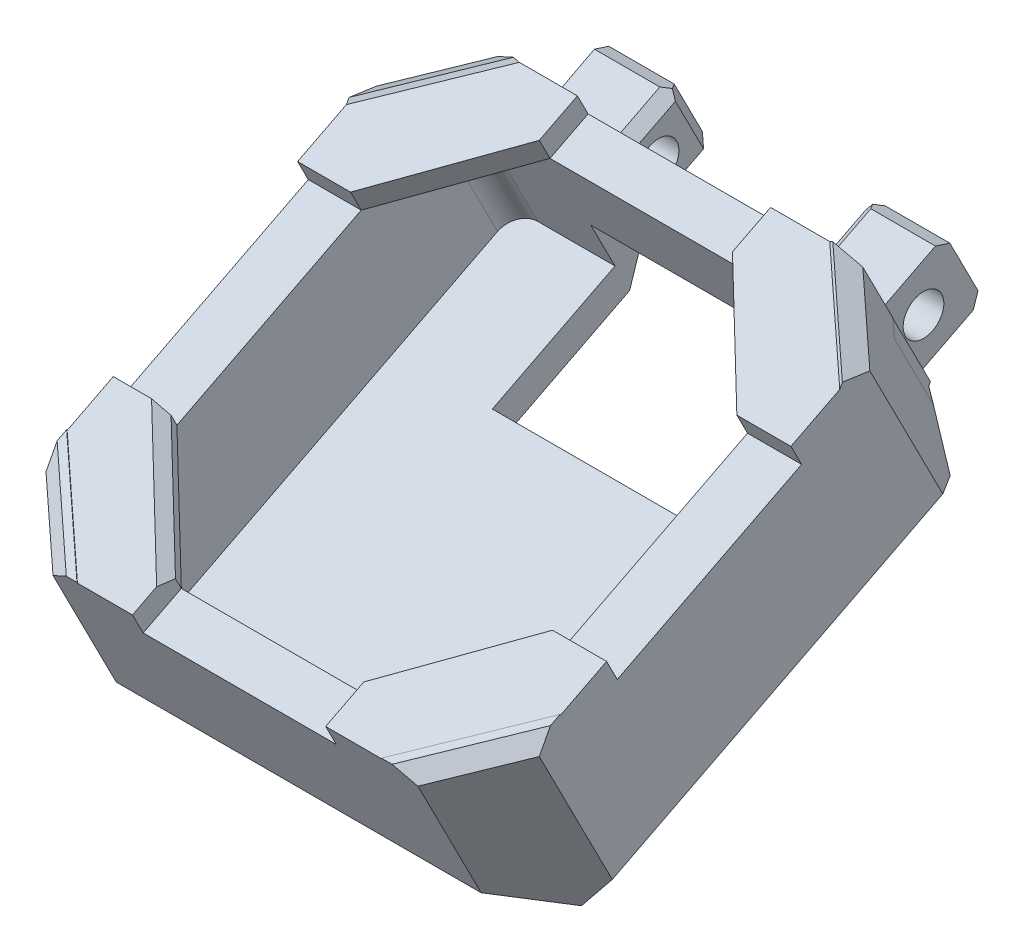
ISO-10303-21;
HEADER;
FILE_DESCRIPTION(('STEP AP214'),'2;1');
FILE_NAME('part.step','',(''),(''),'','','');
FILE_SCHEMA(('AUTOMOTIVE_DESIGN { 1 0 10303 214 1 1 1 1 }'));
ENDSEC;
DATA;
#1=APPLICATION_CONTEXT('core data for automotive mechanical design processes');
#2=APPLICATION_PROTOCOL_DEFINITION('international standard','automotive_design',2000,#1);
#3=PRODUCT_CONTEXT('',#1,'mechanical');
#4=PRODUCT('Part','Part','',(#3));
#5=PRODUCT_RELATED_PRODUCT_CATEGORY('part','',(#4));
#6=PRODUCT_DEFINITION_FORMATION('','',#4);
#7=PRODUCT_DEFINITION_CONTEXT('part definition',#1,'design');
#8=PRODUCT_DEFINITION('design','',#6,#7);
#9=PRODUCT_DEFINITION_SHAPE('','',#8);
#10=(LENGTH_UNIT() NAMED_UNIT(*) SI_UNIT(.MILLI.,.METRE.));
#11=(NAMED_UNIT(*) PLANE_ANGLE_UNIT() SI_UNIT($,.RADIAN.));
#12=(NAMED_UNIT(*) SI_UNIT($,.STERADIAN.) SOLID_ANGLE_UNIT());
#13=UNCERTAINTY_MEASURE_WITH_UNIT(LENGTH_MEASURE(1.E-05),#10,'distance_accuracy_value','');
#14=(GEOMETRIC_REPRESENTATION_CONTEXT(3) GLOBAL_UNCERTAINTY_ASSIGNED_CONTEXT((#13)) GLOBAL_UNIT_ASSIGNED_CONTEXT((#10,
#11,#12)) REPRESENTATION_CONTEXT('',''));
#15=CARTESIAN_POINT('',(0.,0.,0.));
#16=DIRECTION('',(0.,0.,1.));
#17=DIRECTION('',(1.,0.,0.));
#18=AXIS2_PLACEMENT_3D('',#15,#16,#17);
#19=CARTESIAN_POINT('',(1.52503227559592,-8.78850026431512,17.2218730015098));
#20=DIRECTION('',(0.707106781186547,0.321412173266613,-0.629836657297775));
#21=DIRECTION('',(0.,-0.890723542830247,-0.454545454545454));
#22=AXIS2_PLACEMENT_3D('',#19,#20,#21);
#23=PLANE('',#22);
#24=DIRECTION('',(0.577350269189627,-0.776691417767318,0.251827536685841));
#25=VECTOR('',#24,1.);
#26=CARTESIAN_POINT('',(4.19827125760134,-5.24137509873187,22.0332071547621));
#27=LINE('',#26,#25);
#28=CARTESIAN_POINT('',(-0.872510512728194,1.5801904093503,19.8214432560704));
#29=VERTEX_POINT('',#28);
#30=CARTESIAN_POINT('',(0.525032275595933,-0.29988057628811,20.4310207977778));
#31=VERTEX_POINT('',#30);
#32=EDGE_CURVE('E750',#29,#31,#27,.T.);
#33=ORIENTED_EDGE('',*,*,#32,.F.);
#34=DIRECTION('',(0.707106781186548,-0.321412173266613,0.629836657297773));
#35=VECTOR('',#34,1.);
#36=CARTESIAN_POINT('',(1.52503227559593,0.490398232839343,21.9569910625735));
#37=LINE('',#36,#35);
#38=CARTESIAN_POINT('',(-0.866137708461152,1.577293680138,19.8271196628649));
#39=VERTEX_POINT('',#38);
#40=EDGE_CURVE('E11',#29,#39,#37,.T.);
#41=ORIENTED_EDGE('',*,*,#40,.T.);
#42=DIRECTION('',(0.,0.890723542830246,0.454545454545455));
#43=VECTOR('',#42,1.);
#44=CARTESIAN_POINT('',(-0.866137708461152,1.577293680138,19.8271196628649));
#45=LINE('',#44,#43);
#46=CARTESIAN_POINT('',(-0.866137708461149,5.14018785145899,21.6453014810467));
#47=VERTEX_POINT('',#46);
#48=EDGE_CURVE('E2658',#39,#47,#45,.T.);
#49=ORIENTED_EDGE('',*,*,#48,.T.);
#50=DIRECTION('',(0.707106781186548,-0.321412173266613,0.629836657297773));
#51=VECTOR('',#50,1.);
#52=CARTESIAN_POINT('',(1.52503227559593,4.05329240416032,23.7751728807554));
#53=LINE('',#52,#51);
#54=CARTESIAN_POINT('',(-1.47496772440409,5.4169287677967,21.1030022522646));
#55=VERTEX_POINT('',#54);
#56=EDGE_CURVE('E1258',#55,#47,#53,.T.);
#57=ORIENTED_EDGE('',*,*,#56,.F.);
#58=DIRECTION('',(0.,0.890723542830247,0.454545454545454));
#59=VECTOR('',#58,1.);
#60=CARTESIAN_POINT('',(-1.47496772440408,9.07108398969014,22.9677555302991));
#61=LINE('',#60,#59);
#62=CARTESIAN_POINT('',(-1.47496772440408,8.18036044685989,22.5132100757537));
#63=VERTEX_POINT('',#62);
#64=EDGE_CURVE('E791',#55,#63,#61,.T.);
#65=ORIENTED_EDGE('',*,*,#64,.T.);
#66=DIRECTION('',(-0.707106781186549,0.321412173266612,-0.629836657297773));
#67=VECTOR('',#66,1.);
#68=CARTESIAN_POINT('',(-1.47496772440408,8.1803604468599,22.5132100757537));
#69=LINE('',#68,#67);
#70=CARTESIAN_POINT('',(1.52503227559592,6.81672408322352,25.1853807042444));
#71=VERTEX_POINT('',#70);
#72=EDGE_CURVE('E749',#71,#63,#69,.T.);
#73=ORIENTED_EDGE('',*,*,#72,.F.);
#74=DIRECTION('',(0.,-0.890723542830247,-0.454545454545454));
#75=VECTOR('',#74,1.);
#76=CARTESIAN_POINT('',(1.52503227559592,-0.754426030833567,21.321744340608));
#77=LINE('',#76,#75);
#78=CARTESIAN_POINT('',(1.52503227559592,0.136297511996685,21.7762897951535));
#79=VERTEX_POINT('',#78);
#80=EDGE_CURVE('E733',#71,#79,#77,.T.);
#81=ORIENTED_EDGE('',*,*,#80,.T.);
#82=DIRECTION('',(0.577350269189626,0.251827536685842,0.776691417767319));
#83=VECTOR('',#82,1.);
#84=CARTESIAN_POINT('',(-1.81487337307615,-1.32049614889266,17.283218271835));
#85=LINE('',#84,#83);
#86=EDGE_CURVE('E745',#31,#79,#85,.T.);
#87=ORIENTED_EDGE('',*,*,#86,.F.);
#88=EDGE_LOOP('',(#33,#41,#49,#57,#65,#73,#81,#87));
#89=FACE_BOUND('',#88,.T.);
#90=ADVANCED_FACE('F51',(#89),#23,.T.);
#91=CARTESIAN_POINT('',(-21.5250322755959,0.609210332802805,18.6495737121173));
#92=DIRECTION('',(0.,0.454545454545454,-0.890723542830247));
#93=DIRECTION('',(-1.,0.,0.));
#94=AXIS2_PLACEMENT_3D('',#91,#92,#93);
#95=PLANE('',#94);
#96=DIRECTION('',(1.,0.,0.));
#97=VECTOR('',#96,1.);
#98=CARTESIAN_POINT('',(-21.5250322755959,5.41692876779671,21.1030022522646));
#99=LINE('',#98,#97);
#100=CARTESIAN_POINT('',(-1.5,5.41692876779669,21.1030022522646));
#101=VERTEX_POINT('',#100);
#102=EDGE_CURVE('E1256',#101,#55,#99,.T.);
#103=ORIENTED_EDGE('',*,*,#102,.F.);
#104=DIRECTION('',(0.,0.890723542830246,0.454545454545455));
#105=VECTOR('',#104,1.);
#106=CARTESIAN_POINT('',(-1.5,1.8540345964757,19.2848204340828));
#107=LINE('',#106,#105);
#108=CARTESIAN_POINT('',(-1.5,1.94529564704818,19.3313918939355));
#109=VERTEX_POINT('',#108);
#110=EDGE_CURVE('E1297',#109,#101,#107,.T.);
#111=ORIENTED_EDGE('',*,*,#110,.F.);
#112=DIRECTION('',(1.,0.,0.));
#113=VECTOR('',#112,1.);
#114=CARTESIAN_POINT('',(0.,1.94529564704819,19.3313918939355));
#115=LINE('',#114,#113);
#116=CARTESIAN_POINT('',(-2.07672139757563,1.94529564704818,19.3313918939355));
#117=VERTEX_POINT('',#116);
#118=EDGE_CURVE('E1265',#117,#109,#115,.T.);
#119=ORIENTED_EDGE('',*,*,#118,.F.);
#120=DIRECTION('',(0.,0.890723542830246,0.454545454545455));
#121=VECTOR('',#120,1.);
#122=CARTESIAN_POINT('',(-2.07672139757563,1.8540345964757,19.2848204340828));
#123=LINE('',#122,#121);
#124=CARTESIAN_POINT('',(-2.07672139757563,5.41692876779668,21.1030022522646));
#125=VERTEX_POINT('',#124);
#126=EDGE_CURVE('E1295',#117,#125,#123,.T.);
#127=ORIENTED_EDGE('',*,*,#126,.T.);
#128=DIRECTION('',(1.,0.,0.));
#129=VECTOR('',#128,1.);
#130=CARTESIAN_POINT('',(-5.59626822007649,5.41692876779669,21.1030022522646));
#131=LINE('',#130,#129);
#132=CARTESIAN_POINT('',(-5.09626822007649,5.41692876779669,21.1030022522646));
#133=VERTEX_POINT('',#132);
#134=EDGE_CURVE('E606',#133,#125,#131,.T.);
#135=ORIENTED_EDGE('',*,*,#134,.F.);
#136=DIRECTION('',(0.707106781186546,0.629836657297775,0.321412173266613));
#137=VECTOR('',#136,1.);
#138=CARTESIAN_POINT('',(-5.09626822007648,5.4169287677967,21.1030022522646));
#139=LINE('',#138,#137);
#140=CARTESIAN_POINT('',(-5.59626822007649,4.97156699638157,20.8757295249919));
#141=VERTEX_POINT('',#140);
#142=EDGE_CURVE('E1224',#133,#141,#139,.F.);
#143=ORIENTED_EDGE('',*,*,#142,.T.);
#144=DIRECTION('',(0.,0.890723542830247,0.454545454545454));
#145=VECTOR('',#144,1.);
#146=CARTESIAN_POINT('',(-5.59626822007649,3.2791922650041,20.0120931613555));
#147=LINE('',#146,#145);
#148=CARTESIAN_POINT('',(-5.59626822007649,4.16991580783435,20.466638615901));
#149=VERTEX_POINT('',#148);
#150=EDGE_CURVE('E1230',#149,#141,#147,.T.);
#151=ORIENTED_EDGE('',*,*,#150,.F.);
#152=DIRECTION('',(-1.,0.,0.));
#153=VECTOR('',#152,1.);
#154=CARTESIAN_POINT('',(-21.5250322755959,4.16991580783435,20.466638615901));
#155=LINE('',#154,#153);
#156=CARTESIAN_POINT('',(-14.4550223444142,4.16991580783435,20.466638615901));
#157=VERTEX_POINT('',#156);
#158=EDGE_CURVE('E1082',#149,#157,#155,.T.);
#159=ORIENTED_EDGE('',*,*,#158,.T.);
#160=DIRECTION('',(0.,0.890723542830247,0.454545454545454));
#161=VECTOR('',#160,1.);
#162=CARTESIAN_POINT('',(-14.4550223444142,3.2791922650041,20.0120931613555));
#163=LINE('',#162,#161);
#164=CARTESIAN_POINT('',(-14.4550223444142,4.97156699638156,20.8757295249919));
#165=VERTEX_POINT('',#164);
#166=EDGE_CURVE('E601',#157,#165,#163,.T.);
#167=ORIENTED_EDGE('',*,*,#166,.T.);
#168=DIRECTION('',(-0.707106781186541,0.629836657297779,0.321412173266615));
#169=VECTOR('',#168,1.);
#170=CARTESIAN_POINT('',(-14.9550223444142,5.4169287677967,21.1030022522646));
#171=LINE('',#170,#169);
#172=CARTESIAN_POINT('',(-14.9550223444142,5.41692876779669,21.1030022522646));
#173=VERTEX_POINT('',#172);
#174=EDGE_CURVE('E60',#165,#173,#171,.T.);
#175=ORIENTED_EDGE('',*,*,#174,.T.);
#176=DIRECTION('',(1.,0.,0.));
#177=VECTOR('',#176,1.);
#178=CARTESIAN_POINT('',(-21.5250322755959,5.4169287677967,21.1030022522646));
#179=LINE('',#178,#177);
#180=CARTESIAN_POINT('',(-17.9947021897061,5.4169287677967,21.1030022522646));
#181=VERTEX_POINT('',#180);
#182=EDGE_CURVE('E589',#181,#173,#179,.T.);
#183=ORIENTED_EDGE('',*,*,#182,.F.);
#184=DIRECTION('',(0.,0.890723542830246,0.454545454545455));
#185=VECTOR('',#184,1.);
#186=CARTESIAN_POINT('',(-17.9947021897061,1.85403459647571,19.2848204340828));
#187=LINE('',#186,#185);
#188=CARTESIAN_POINT('',(-17.9947021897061,1.94529564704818,19.3313918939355));
#189=VERTEX_POINT('',#188);
#190=EDGE_CURVE('E571',#189,#181,#187,.T.);
#191=ORIENTED_EDGE('',*,*,#190,.F.);
#192=DIRECTION('',(-1.,0.,0.));
#193=VECTOR('',#192,1.);
#194=CARTESIAN_POINT('',(0.,1.94529564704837,19.3313918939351));
#195=LINE('',#194,#193);
#196=CARTESIAN_POINT('',(-18.525032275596,1.94529564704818,19.3313918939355));
#197=VERTEX_POINT('',#196);
#198=EDGE_CURVE('E1267',#189,#197,#195,.T.);
#199=ORIENTED_EDGE('',*,*,#198,.T.);
#200=DIRECTION('',(0.,-0.890723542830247,-0.454545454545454));
#201=VECTOR('',#200,1.);
#202=CARTESIAN_POINT('',(-18.525032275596,0.609210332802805,18.6495737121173));
#203=LINE('',#202,#201);
#204=CARTESIAN_POINT('',(-18.525032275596,8.1803604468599,22.5132100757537));
#205=VERTEX_POINT('',#204);
#206=EDGE_CURVE('E817',#205,#197,#203,.T.);
#207=ORIENTED_EDGE('',*,*,#206,.F.);
#208=DIRECTION('',(-0.816496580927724,-0.514259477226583,-0.26243194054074));
#209=VECTOR('',#208,1.);
#210=CARTESIAN_POINT('',(-24.5319707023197,4.39697042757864,20.5825069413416));
#211=LINE('',#210,#209);
#212=CARTESIAN_POINT('',(-17.4643721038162,8.84840310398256,22.8541191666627));
#213=VERTEX_POINT('',#212);
#214=EDGE_CURVE('E809',#213,#205,#211,.T.);
#215=ORIENTED_EDGE('',*,*,#214,.F.);
#216=DIRECTION('',(0.81649658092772,-0.514259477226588,-0.262431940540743));
#217=VECTOR('',#216,1.);
#218=CARTESIAN_POINT('',(-15.8109870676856,7.80704059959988,22.3227010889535));
#219=LINE('',#218,#217);
#220=CARTESIAN_POINT('',(-17.2522400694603,8.71479457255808,22.7859373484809));
#221=VERTEX_POINT('',#220);
#222=EDGE_CURVE('E1114',#213,#221,#219,.T.);
#223=ORIENTED_EDGE('',*,*,#222,.T.);
#224=DIRECTION('',(-1.,0.,0.));
#225=VECTOR('',#224,1.);
#226=CARTESIAN_POINT('',(-17.1108187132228,8.71479457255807,22.785937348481));
#227=LINE('',#226,#225);
#228=CARTESIAN_POINT('',(-14.538467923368,8.71479457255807,22.785937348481));
#229=VERTEX_POINT('',#228);
#230=EDGE_CURVE('E643',#229,#221,#227,.T.);
#231=ORIENTED_EDGE('',*,*,#230,.F.);
#232=DIRECTION('',(0.,-0.890723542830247,-0.454545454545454));
#233=VECTOR('',#232,1.);
#234=CARTESIAN_POINT('',(-14.538467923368,9.07108398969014,22.9677555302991));
#235=LINE('',#234,#233);
#236=CARTESIAN_POINT('',(-14.538467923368,7.73499867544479,22.2859373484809));
#237=VERTEX_POINT('',#236);
#238=EDGE_CURVE('E834',#229,#237,#235,.T.);
#239=ORIENTED_EDGE('',*,*,#238,.T.);
#240=DIRECTION('',(1.,0.,0.));
#241=VECTOR('',#240,1.);
#242=CARTESIAN_POINT('',(-21.5250322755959,7.73499867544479,22.2859373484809));
#243=LINE('',#242,#241);
#244=CARTESIAN_POINT('',(-5.51282264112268,7.73499867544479,22.2859373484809));
#245=VERTEX_POINT('',#244);
#246=EDGE_CURVE('E705',#237,#245,#243,.T.);
#247=ORIENTED_EDGE('',*,*,#246,.T.);
#248=DIRECTION('',(0.,-0.890723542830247,-0.454545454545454));
#249=VECTOR('',#248,1.);
#250=CARTESIAN_POINT('',(-5.51282264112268,9.07108398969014,22.9677555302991));
#251=LINE('',#250,#249);
#252=CARTESIAN_POINT('',(-5.51282264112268,8.71479457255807,22.785937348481));
#253=VERTEX_POINT('',#252);
#254=EDGE_CURVE('E790',#253,#245,#251,.T.);
#255=ORIENTED_EDGE('',*,*,#254,.F.);
#256=CARTESIAN_POINT('',(-2.74775993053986,8.71479457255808,22.7859373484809));
#257=VERTEX_POINT('',#256);
#258=EDGE_CURVE('E644',#257,#253,#227,.T.);
#259=ORIENTED_EDGE('',*,*,#258,.F.);
#260=DIRECTION('',(0.816496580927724,0.514259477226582,0.26243194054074));
#261=VECTOR('',#260,1.);
#262=CARTESIAN_POINT('',(-19.5557226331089,-1.87147647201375,17.383653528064));
#263=LINE('',#262,#261);
#264=CARTESIAN_POINT('',(-2.53562789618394,8.84840310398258,22.8541191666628));
#265=VERTEX_POINT('',#264);
#266=EDGE_CURVE('E1117',#257,#265,#263,.T.);
#267=ORIENTED_EDGE('',*,*,#266,.T.);
#268=DIRECTION('',(-0.816496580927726,0.51425947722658,0.262431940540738));
#269=VECTOR('',#268,1.);
#270=CARTESIAN_POINT('',(-10.8347389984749,14.0754874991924,25.5215545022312));
#271=LINE('',#270,#269);
#272=EDGE_CURVE('E786',#63,#265,#271,.T.);
#273=ORIENTED_EDGE('',*,*,#272,.F.);
#274=ORIENTED_EDGE('',*,*,#64,.F.);
#275=EDGE_LOOP('',(#103,#111,#119,#127,#135,#143,#151,#159,#167,#175,#183,#191,#199,#207,#215,
#223,#231,#239,#247,#255,#259,#267,#273,#274));
#276=FACE_BOUND('',#275,.T.);
#277=ADVANCED_FACE('F596',(#276),#95,.T.);
#278=CARTESIAN_POINT('',(-21.5250322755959,2.39065741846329,19.5586646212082));
#279=DIRECTION('',(0.,0.308424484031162,0.951248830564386));
#280=DIRECTION('',(-1.,0.,0.));
#281=AXIS2_PLACEMENT_3D('',#278,#279,#280);
#282=PLANE('',#281);
#283=DIRECTION('',(-0.577350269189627,-0.776691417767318,0.251827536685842));
#284=VECTOR('',#283,1.);
#285=CARTESIAN_POINT('',(-7.84167742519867,-6.81323911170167,22.5428544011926));
#286=LINE('',#285,#284);
#287=CARTESIAN_POINT('',(-1.5,1.71802291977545,19.7767536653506));
#288=VERTEX_POINT('',#287);
#289=CARTESIAN_POINT('',(-1.24496410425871,2.06111480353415,19.6655125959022));
#290=VERTEX_POINT('',#289);
#291=EDGE_CURVE('E1179',#288,#290,#286,.F.);
#292=ORIENTED_EDGE('',*,*,#291,.T.);
#293=DIRECTION('',(0.592853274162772,-0.766050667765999,0.248377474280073));
#294=VECTOR('',#293,1.);
#295=CARTESIAN_POINT('',(-8.53829831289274,11.4851388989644,16.6099506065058));
#296=LINE('',#295,#294);
#297=CARTESIAN_POINT('',(-0.872772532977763,1.58019040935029,19.8214432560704));
#298=VERTEX_POINT('',#297);
#299=EDGE_CURVE('E1262',#290,#298,#296,.T.);
#300=ORIENTED_EDGE('',*,*,#299,.T.);
#301=DIRECTION('',(-1.,0.,0.));
#302=VECTOR('',#301,1.);
#303=CARTESIAN_POINT('',(-21.5250322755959,1.58019040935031,19.8214432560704));
#304=LINE('',#303,#302);
#305=EDGE_CURVE('E1269',#29,#298,#304,.T.);
#306=ORIENTED_EDGE('',*,*,#305,.F.);
#307=ORIENTED_EDGE('',*,*,#32,.T.);
#308=DIRECTION('',(-1.,0.,0.));
#309=VECTOR('',#308,1.);
#310=CARTESIAN_POINT('',(-21.5250322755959,-0.29988057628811,20.4310207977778));
#311=LINE('',#310,#309);
#312=CARTESIAN_POINT('',(-5.59626822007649,-0.29988057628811,20.4310207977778));
#313=VERTEX_POINT('',#312);
#314=EDGE_CURVE('E778',#31,#313,#311,.T.);
#315=ORIENTED_EDGE('',*,*,#314,.T.);
#316=DIRECTION('',(0.,-0.951248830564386,0.308424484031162));
#317=VECTOR('',#316,1.);
#318=CARTESIAN_POINT('',(-5.59626822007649,2.39065741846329,19.5586646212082));
#319=LINE('',#318,#317);
#320=CARTESIAN_POINT('',(-5.59626822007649,2.3906574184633,19.5586646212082));
#321=VERTEX_POINT('',#320);
#322=EDGE_CURVE('E1080',#321,#313,#319,.T.);
#323=ORIENTED_EDGE('',*,*,#322,.F.);
#324=DIRECTION('',(0.577350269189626,-0.776691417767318,0.251827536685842));
#325=VECTOR('',#324,1.);
#326=CARTESIAN_POINT('',(-10.905856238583,9.53348156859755,17.2427386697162));
#327=LINE('',#326,#325);
#328=CARTESIAN_POINT('',(-5.0962682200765,1.71802291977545,19.7767536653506));
#329=VERTEX_POINT('',#328);
#330=EDGE_CURVE('E1177',#321,#329,#327,.T.);
#331=ORIENTED_EDGE('',*,*,#330,.T.);
#332=DIRECTION('',(-1.,0.,0.));
#333=VECTOR('',#332,1.);
#334=CARTESIAN_POINT('',(-21.5250322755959,1.71802291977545,19.7767536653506));
#335=LINE('',#334,#333);
#336=EDGE_CURVE('E614',#288,#329,#335,.T.);
#337=ORIENTED_EDGE('',*,*,#336,.F.);
#338=EDGE_LOOP('',(#292,#300,#306,#307,#315,#323,#331,#337));
#339=FACE_BOUND('',#338,.T.);
#340=ADVANCED_FACE('F1418',(#339),#282,.F.);
#341=DIRECTION('',(0.577350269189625,0.776691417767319,-0.251827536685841));
#342=VECTOR('',#341,1.);
#343=CARTESIAN_POINT('',(-19.1916989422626,1.49381142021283,19.8494500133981));
#344=LINE('',#343,#342);
#345=CARTESIAN_POINT('',(-20.525032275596,-0.29988057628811,20.4310207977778));
#346=VERTEX_POINT('',#345);
#347=CARTESIAN_POINT('',(-18.7881614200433,2.03667793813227,19.6734357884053));
#348=VERTEX_POINT('',#347);
#349=EDGE_CURVE('E716',#346,#348,#344,.T.);
#350=ORIENTED_EDGE('',*,*,#349,.T.);
#351=DIRECTION('',(-0.577350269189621,0.776691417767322,-0.251827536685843));
#352=VECTOR('',#351,1.);
#353=CARTESIAN_POINT('',(-19.8758711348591,3.4999400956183,19.1990006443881));
#354=LINE('',#353,#352);
#355=CARTESIAN_POINT('',(-18.5512905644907,1.71802291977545,19.7767536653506));
#356=VERTEX_POINT('',#355);
#357=EDGE_CURVE('E1182',#348,#356,#354,.F.);
#358=ORIENTED_EDGE('',*,*,#357,.T.);
#359=DIRECTION('',(1.,0.,0.));
#360=VECTOR('',#359,1.);
#361=CARTESIAN_POINT('',(-21.5250322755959,1.71802291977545,19.7767536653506));
#362=LINE('',#361,#360);
#363=CARTESIAN_POINT('',(-14.9550223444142,1.71802291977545,19.7767536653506));
#364=VERTEX_POINT('',#363);
#365=EDGE_CURVE('E611',#356,#364,#362,.T.);
#366=ORIENTED_EDGE('',*,*,#365,.T.);
#367=DIRECTION('',(0.577350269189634,0.776691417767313,-0.25182753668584));
#368=VECTOR('',#367,1.);
#369=CARTESIAN_POINT('',(-16.8116923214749,-0.779697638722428,20.5865924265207));
#370=LINE('',#369,#368);
#371=CARTESIAN_POINT('',(-14.4550223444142,2.39065741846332,19.5586646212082));
#372=VERTEX_POINT('',#371);
#373=EDGE_CURVE('E1184',#364,#372,#370,.T.);
#374=ORIENTED_EDGE('',*,*,#373,.T.);
#375=DIRECTION('',(0.,-0.951248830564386,0.308424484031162));
#376=VECTOR('',#375,1.);
#377=CARTESIAN_POINT('',(-14.4550223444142,2.39065741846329,19.5586646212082));
#378=LINE('',#377,#376);
#379=CARTESIAN_POINT('',(-14.4550223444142,-0.29988057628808,20.4310207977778));
#380=VERTEX_POINT('',#379);
#381=EDGE_CURVE('E1078',#372,#380,#378,.T.);
#382=ORIENTED_EDGE('',*,*,#381,.T.);
#383=EDGE_CURVE('E783',#380,#346,#311,.T.);
#384=ORIENTED_EDGE('',*,*,#383,.T.);
#385=EDGE_LOOP('',(#350,#358,#366,#374,#382,#384));
#386=FACE_BOUND('',#385,.T.);
#387=ADVANCED_FACE('F1328',(#386),#282,.F.);
#388=CARTESIAN_POINT('',(-19.,1.03620473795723,21.112838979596));
#389=DIRECTION('',(0.,0.454545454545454,-0.890723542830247));
#390=DIRECTION('',(-1.,0.,0.));
#391=AXIS2_PLACEMENT_3D('',#388,#389,#390);
#392=PLANE('',#391);
#393=DIRECTION('',(0.,-0.890723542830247,-0.454545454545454));
#394=VECTOR('',#393,1.);
#395=CARTESIAN_POINT('',(-5.59626822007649,-8.3339548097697,16.3311494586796));
#396=LINE('',#395,#394);
#397=CARTESIAN_POINT('',(-5.59626822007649,3.26082489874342,22.2480857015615));
#398=VERTEX_POINT('',#397);
#399=CARTESIAN_POINT('',(-5.59626822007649,1.03620473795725,21.112838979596));
#400=VERTEX_POINT('',#399);
#401=EDGE_CURVE('E700',#398,#400,#396,.T.);
#402=ORIENTED_EDGE('',*,*,#401,.T.);
#403=DIRECTION('',(1.,0.,0.));
#404=VECTOR('',#403,1.);
#405=CARTESIAN_POINT('',(-19.,1.03620473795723,21.112838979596));
#406=LINE('',#405,#404);
#407=CARTESIAN_POINT('',(-2.,1.03620473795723,21.112838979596));
#408=VERTEX_POINT('',#407);
#409=EDGE_CURVE('E761',#400,#408,#406,.T.);
#410=ORIENTED_EDGE('',*,*,#409,.T.);
#411=DIRECTION('',(0.,-0.890723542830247,-0.454545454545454));
#412=VECTOR('',#411,1.);
#413=CARTESIAN_POINT('',(-2.,1.03620473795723,21.112838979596));
#414=LINE('',#413,#412);
#415=CARTESIAN_POINT('',(-2.,6.82590776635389,24.0673844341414));
#416=VERTEX_POINT('',#415);
#417=EDGE_CURVE('E751',#416,#408,#414,.T.);
#418=ORIENTED_EDGE('',*,*,#417,.F.);
#419=DIRECTION('',(1.,0.,0.));
#420=VECTOR('',#419,1.);
#421=CARTESIAN_POINT('',(-19.,6.82590776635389,24.0673844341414));
#422=LINE('',#421,#420);
#423=CARTESIAN_POINT('',(-5.51282264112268,6.82590776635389,24.0673844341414));
#424=VERTEX_POINT('',#423);
#425=EDGE_CURVE('E722',#424,#416,#422,.T.);
#426=ORIENTED_EDGE('',*,*,#425,.F.);
#427=DIRECTION('',(1.,0.,0.));
#428=VECTOR('',#427,1.);
#429=CARTESIAN_POINT('',(-19.,6.82590776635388,24.0673844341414));
#430=LINE('',#429,#428);
#431=CARTESIAN_POINT('',(-14.538467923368,6.82590776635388,24.0673844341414));
#432=VERTEX_POINT('',#431);
#433=EDGE_CURVE('E743',#432,#424,#430,.T.);
#434=ORIENTED_EDGE('',*,*,#433,.F.);
#435=DIRECTION('',(1.,0.,0.));
#436=VECTOR('',#435,1.);
#437=CARTESIAN_POINT('',(-19.,6.82590776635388,24.0673844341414));
#438=LINE('',#437,#436);
#439=CARTESIAN_POINT('',(-18.0512905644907,6.82590776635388,24.0673844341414));
#440=VERTEX_POINT('',#439);
#441=EDGE_CURVE('E739',#440,#432,#438,.T.);
#442=ORIENTED_EDGE('',*,*,#441,.F.);
#443=DIRECTION('',(0.,0.890723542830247,0.454545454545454));
#444=VECTOR('',#443,1.);
#445=CARTESIAN_POINT('',(-18.0512905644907,6.82590776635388,24.0673844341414));
#446=LINE('',#445,#444);
#447=CARTESIAN_POINT('',(-18.0512905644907,1.03620473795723,21.112838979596));
#448=VERTEX_POINT('',#447);
#449=EDGE_CURVE('E744',#448,#440,#446,.T.);
#450=ORIENTED_EDGE('',*,*,#449,.F.);
#451=CARTESIAN_POINT('',(-14.4550223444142,1.03620473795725,21.112838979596));
#452=VERTEX_POINT('',#451);
#453=EDGE_CURVE('E723',#448,#452,#406,.T.);
#454=ORIENTED_EDGE('',*,*,#453,.T.);
#455=DIRECTION('',(0.,-0.890723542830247,-0.454545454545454));
#456=VECTOR('',#455,1.);
#457=CARTESIAN_POINT('',(-14.4550223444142,-8.3339548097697,16.3311494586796));
#458=LINE('',#457,#456);
#459=CARTESIAN_POINT('',(-14.4550223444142,3.26082489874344,22.2480857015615));
#460=VERTEX_POINT('',#459);
#461=EDGE_CURVE('E698',#460,#452,#458,.T.);
#462=ORIENTED_EDGE('',*,*,#461,.F.);
#463=DIRECTION('',(1.,0.,0.));
#464=VECTOR('',#463,1.);
#465=CARTESIAN_POINT('',(0.,3.26082489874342,22.2480857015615));
#466=LINE('',#465,#464);
#467=EDGE_CURVE('E695',#460,#398,#466,.T.);
#468=ORIENTED_EDGE('',*,*,#467,.T.);
#469=EDGE_LOOP('',(#402,#410,#418,#426,#434,#442,#450,#454,#462,#468));
#470=FACE_BOUND('',#469,.T.);
#471=ADVANCED_FACE('F1362',(#470),#392,.F.);
#472=CARTESIAN_POINT('',(1.52503227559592,0.,0.));
#473=DIRECTION('',(-1.,0.,0.));
#474=DIRECTION('',(0.,0.,1.));
#475=AXIS2_PLACEMENT_3D('',#472,#473,#474);
#476=PLANE('',#475);
#477=DIRECTION('',(0.,0.890723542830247,0.454545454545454));
#478=VECTOR('',#477,1.);
#479=CARTESIAN_POINT('',(1.52503227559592,0.112044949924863,39.6438149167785));
#480=LINE('',#479,#478);
#481=CARTESIAN_POINT('',(1.52503227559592,0.112044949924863,39.6438149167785));
#482=VERTEX_POINT('',#481);
#483=CARTESIAN_POINT('',(1.52503227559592,0.153416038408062,39.6649270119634));
#484=VERTEX_POINT('',#483);
#485=EDGE_CURVE('E647',#482,#484,#480,.T.);
#486=ORIENTED_EDGE('',*,*,#485,.T.);
#487=DIRECTION('',(0.,-0.454545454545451,0.890723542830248));
#488=VECTOR('',#487,1.);
#489=CARTESIAN_POINT('',(1.52503227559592,0.15341603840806,39.6649270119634));
#490=LINE('',#489,#488);
#491=CARTESIAN_POINT('',(1.52503227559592,-0.07385668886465,40.1102887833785));
#492=VERTEX_POINT('',#491);
#493=EDGE_CURVE('E1105',#484,#492,#490,.T.);
#494=ORIENTED_EDGE('',*,*,#493,.T.);
#495=DIRECTION('',(0.,-0.885394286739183,0.464840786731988));
#496=VECTOR('',#495,1.);
#497=CARTESIAN_POINT('',(1.52503227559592,12.6624705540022,33.4235905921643));
#498=LINE('',#497,#496);
#499=CARTESIAN_POINT('',(1.52503227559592,-1.06521352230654,40.6307609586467));
#500=VERTEX_POINT('',#499);
#501=EDGE_CURVE('E918',#492,#500,#498,.T.);
#502=ORIENTED_EDGE('',*,*,#501,.T.);
#503=DIRECTION('',(0.,-0.890723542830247,-0.454545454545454));
#504=VECTOR('',#503,1.);
#505=CARTESIAN_POINT('',(1.52503227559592,-8.63636363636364,36.7671245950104));
#506=LINE('',#505,#504);
#507=CARTESIAN_POINT('',(1.52503227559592,-7.74564009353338,37.2216700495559));
#508=VERTEX_POINT('',#507);
#509=EDGE_CURVE('E913',#500,#508,#506,.T.);
#510=ORIENTED_EDGE('',*,*,#509,.T.);
#511=DIRECTION('',(0.,0.454545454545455,-0.890723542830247));
#512=VECTOR('',#511,1.);
#513=CARTESIAN_POINT('',(1.52503227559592,0.390723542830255,21.2777186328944));
#514=LINE('',#513,#512);
#515=EDGE_CURVE('E876',#508,#79,#514,.T.);
#516=ORIENTED_EDGE('',*,*,#515,.T.);
#517=ORIENTED_EDGE('',*,*,#80,.F.);
#518=DIRECTION('',(0.,-0.143124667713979,-0.989704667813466));
#519=VECTOR('',#518,1.);
#520=CARTESIAN_POINT('',(1.52503227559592,9.03581477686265,40.5303554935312));
#521=LINE('',#520,#519);
#522=CARTESIAN_POINT('',(1.52503227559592,7.00264848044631,26.4710447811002));
#523=VERTEX_POINT('',#522);
#524=EDGE_CURVE('E782',#523,#71,#521,.T.);
#525=ORIENTED_EDGE('',*,*,#524,.F.);
#526=DIRECTION('',(0.,-0.885394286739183,0.464840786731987));
#527=VECTOR('',#526,1.);
#528=CARTESIAN_POINT('',(1.52503227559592,-5.31928336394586,32.94018127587));
#529=LINE('',#528,#527);
#530=CARTESIAN_POINT('',(1.52503227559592,6.77261629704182,26.5918139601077));
#531=VERTEX_POINT('',#530);
#532=EDGE_CURVE('E1102',#523,#531,#529,.T.);
#533=ORIENTED_EDGE('',*,*,#532,.T.);
#534=DIRECTION('',(0.,0.454545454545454,-0.890723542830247));
#535=VECTOR('',#534,1.);
#536=CARTESIAN_POINT('',(1.52503227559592,6.70833386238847,26.7177812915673));
#537=LINE('',#536,#535);
#538=CARTESIAN_POINT('',(1.52503227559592,5.60794653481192,28.8740912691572));
#539=VERTEX_POINT('',#538);
#540=EDGE_CURVE('E640',#539,#531,#537,.T.);
#541=ORIENTED_EDGE('',*,*,#540,.F.);
#542=DIRECTION('',(0.,-0.890723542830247,-0.454545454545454));
#543=VECTOR('',#542,1.);
#544=CARTESIAN_POINT('',(1.52503227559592,5.96423595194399,29.0559094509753));
#545=LINE('',#544,#543);
#546=CARTESIAN_POINT('',(1.52503227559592,4.62815063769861,28.3740912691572));
#547=VERTEX_POINT('',#546);
#548=EDGE_CURVE('E767',#539,#547,#545,.T.);
#549=ORIENTED_EDGE('',*,*,#548,.T.);
#550=DIRECTION('',(0.,-0.454545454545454,0.890723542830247));
#551=VECTOR('',#550,1.);
#552=CARTESIAN_POINT('',(1.52503227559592,-2.87421165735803,43.0756588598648));
#553=LINE('',#552,#551);
#554=CARTESIAN_POINT('',(1.52503227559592,0.232636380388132,36.9875049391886));
#555=VERTEX_POINT('',#554);
#556=EDGE_CURVE('E896',#547,#555,#553,.T.);
#557=ORIENTED_EDGE('',*,*,#556,.T.);
#558=DIRECTION('',(0.,-0.890723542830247,-0.454545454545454));
#559=VECTOR('',#558,1.);
#560=CARTESIAN_POINT('',(1.52503227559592,1.5687216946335,37.6693231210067));
#561=LINE('',#560,#559);
#562=CARTESIAN_POINT('',(1.52503227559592,1.21243227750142,37.4875049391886));
#563=VERTEX_POINT('',#562);
#564=EDGE_CURVE('E954',#563,#555,#561,.T.);
#565=ORIENTED_EDGE('',*,*,#564,.F.);
#566=EDGE_CURVE('E641',#482,#563,#537,.T.);
#567=ORIENTED_EDGE('',*,*,#566,.F.);
#568=EDGE_LOOP('',(#486,#494,#502,#510,#516,#517,#525,#533,#541,#549,#557,#565,#567));
#569=FACE_BOUND('',#568,.T.);
#570=ADVANCED_FACE('F1405',(#569),#476,.F.);
#571=CARTESIAN_POINT('',(-19.0512905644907,5.,23.0139857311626));
#572=DIRECTION('',(-1.,0.,0.));
#573=DIRECTION('',(0.,0.,1.));
#574=AXIS2_PLACEMENT_3D('',#571,#572,#573);
#575=PLANE('',#574);
#576=DIRECTION('',(0.,0.454545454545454,-0.890723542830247));
#577=VECTOR('',#576,1.);
#578=CARTESIAN_POINT('',(-19.0512905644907,0.426994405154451,22.3066425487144));
#579=LINE('',#578,#577);
#580=CARTESIAN_POINT('',(-19.0512905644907,-7.30027832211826,37.4489427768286));
#581=VERTEX_POINT('',#580);
#582=CARTESIAN_POINT('',(-19.0512905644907,0.581659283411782,22.0035625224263));
#583=VERTEX_POINT('',#582);
#584=EDGE_CURVE('E881',#581,#583,#579,.T.);
#585=ORIENTED_EDGE('',*,*,#584,.T.);
#586=DIRECTION('',(0.,-0.890723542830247,-0.454545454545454));
#587=VECTOR('',#586,1.);
#588=CARTESIAN_POINT('',(-19.0512905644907,0.581659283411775,22.0035625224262));
#589=LINE('',#588,#587);
#590=CARTESIAN_POINT('',(-19.0512905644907,6.37136231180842,24.9581079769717));
#591=VERTEX_POINT('',#590);
#592=EDGE_CURVE('E707',#591,#583,#589,.T.);
#593=ORIENTED_EDGE('',*,*,#592,.F.);
#594=DIRECTION('',(0.,-0.454545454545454,0.890723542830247));
#595=VECTOR('',#594,1.);
#596=CARTESIAN_POINT('',(-19.0512905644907,-2.01436117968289,41.3907029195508));
#597=LINE('',#596,#595);
#598=CARTESIAN_POINT('',(-19.0512905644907,4.62815063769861,28.3740912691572));
#599=VERTEX_POINT('',#598);
#600=EDGE_CURVE('E727',#591,#599,#597,.T.);
#601=ORIENTED_EDGE('',*,*,#600,.T.);
#602=DIRECTION('',(0.,-0.454545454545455,0.890723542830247));
#603=VECTOR('',#602,1.);
#604=CARTESIAN_POINT('',(-19.0512905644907,-1.96512074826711,41.2942117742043));
#605=LINE('',#604,#603);
#606=CARTESIAN_POINT('',(-19.0512905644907,0.232636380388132,36.9875049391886));
#607=VERTEX_POINT('',#606);
#608=EDGE_CURVE('E882',#599,#607,#605,.T.);
#609=ORIENTED_EDGE('',*,*,#608,.T.);
#610=DIRECTION('',(0.,0.454545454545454,-0.890723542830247));
#611=VECTOR('',#610,1.);
#612=CARTESIAN_POINT('',(-19.0512905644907,6.87514819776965,23.9708932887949));
#613=LINE('',#612,#611);
#614=CARTESIAN_POINT('',(-19.0512905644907,-1.51057529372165,40.403488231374));
#615=VERTEX_POINT('',#614);
#616=EDGE_CURVE('E907',#615,#607,#613,.T.);
#617=ORIENTED_EDGE('',*,*,#616,.F.);
#618=DIRECTION('',(0.,-0.890723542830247,-0.454545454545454));
#619=VECTOR('',#618,1.);
#620=CARTESIAN_POINT('',(-19.0512905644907,-7.30027832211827,37.4489427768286));
#621=LINE('',#620,#619);
#622=EDGE_CURVE('E877',#615,#581,#621,.T.);
#623=ORIENTED_EDGE('',*,*,#622,.T.);
#624=EDGE_LOOP('',(#585,#593,#601,#609,#617,#623));
#625=FACE_BOUND('',#624,.T.);
#626=ADVANCED_FACE('F1372',(#625),#575,.F.);
#627=CARTESIAN_POINT('',(0.,9.37015954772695,4.78168952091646));
#628=DIRECTION('',(0.,0.890723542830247,0.454545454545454));
#629=DIRECTION('',(1.,0.,0.));
#630=AXIS2_PLACEMENT_3D('',#627,#628,#629);
#631=PLANE('',#630);
#632=DIRECTION('',(0.,0.454545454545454,-0.890723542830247));
#633=VECTOR('',#632,1.);
#634=CARTESIAN_POINT('',(-5.59626822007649,9.37015954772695,4.78168952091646));
#635=LINE('',#634,#633);
#636=CARTESIAN_POINT('',(-5.59626822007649,-1.88801941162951,26.8431246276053));
#637=VERTEX_POINT('',#636);
#638=EDGE_CURVE('E690',#637,#400,#635,.T.);
#639=ORIENTED_EDGE('',*,*,#638,.F.);
#640=DIRECTION('',(1.,0.,0.));
#641=VECTOR('',#640,1.);
#642=CARTESIAN_POINT('',(-5.59626822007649,-1.88801941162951,26.8431246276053));
#643=LINE('',#642,#641);
#644=CARTESIAN_POINT('',(-14.4550223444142,-1.88801941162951,26.8431246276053));
#645=VERTEX_POINT('',#644);
#646=EDGE_CURVE('E618',#645,#637,#643,.T.);
#647=ORIENTED_EDGE('',*,*,#646,.F.);
#648=DIRECTION('',(0.,-0.454545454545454,0.890723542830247));
#649=VECTOR('',#648,1.);
#650=CARTESIAN_POINT('',(-14.4550223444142,9.37015954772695,4.78168952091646));
#651=LINE('',#650,#649);
#652=EDGE_CURVE('E693',#452,#645,#651,.T.);
#653=ORIENTED_EDGE('',*,*,#652,.F.);
#654=ORIENTED_EDGE('',*,*,#453,.F.);
#655=CARTESIAN_POINT('',(-18.0512905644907,0.581659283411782,22.0035625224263));
#656=DIRECTION('',(0.,-0.890723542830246,-0.454545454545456));
#657=DIRECTION('',(0.,0.454545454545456,-0.890723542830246));
#658=AXIS2_PLACEMENT_3D('',#655,#656,#657);
#659=CIRCLE('',#658,1.);
#660=EDGE_CURVE('E711',#583,#448,#659,.T.);
#661=ORIENTED_EDGE('',*,*,#660,.F.);
#662=ORIENTED_EDGE('',*,*,#584,.F.);
#663=CARTESIAN_POINT('',(-18.0512905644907,-7.30027832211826,37.4489427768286));
#664=DIRECTION('',(0.,0.890723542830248,0.454545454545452));
#665=DIRECTION('',(0.,-0.454545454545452,0.890723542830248));
#666=AXIS2_PLACEMENT_3D('',#663,#664,#665);
#667=CIRCLE('',#666,1.);
#668=CARTESIAN_POINT('',(-18.0512905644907,-7.75482377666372,38.3396663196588));
#669=VERTEX_POINT('',#668);
#670=EDGE_CURVE('E945',#581,#669,#667,.T.);
#671=ORIENTED_EDGE('',*,*,#670,.T.);
#672=DIRECTION('',(1.,0.,0.));
#673=VECTOR('',#672,1.);
#674=CARTESIAN_POINT('',(-19.,-7.75482377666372,38.3396663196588));
#675=LINE('',#674,#673);
#676=CARTESIAN_POINT('',(-2.,-7.75482377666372,38.3396663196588));
#677=VERTEX_POINT('',#676);
#678=EDGE_CURVE('E902',#669,#677,#675,.T.);
#679=ORIENTED_EDGE('',*,*,#678,.T.);
#680=CARTESIAN_POINT('',(-2.,-7.30027832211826,37.4489427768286));
#681=DIRECTION('',(0.,0.890723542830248,0.454545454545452));
#682=DIRECTION('',(0.,-0.454545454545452,0.890723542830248));
#683=AXIS2_PLACEMENT_3D('',#680,#681,#682);
#684=CIRCLE('',#683,1.);
#685=CARTESIAN_POINT('',(-1.,-7.30027832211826,37.4489427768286));
#686=VERTEX_POINT('',#685);
#687=EDGE_CURVE('E897',#677,#686,#684,.T.);
#688=ORIENTED_EDGE('',*,*,#687,.T.);
#689=DIRECTION('',(0.,0.454545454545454,-0.890723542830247));
#690=VECTOR('',#689,1.);
#691=CARTESIAN_POINT('',(-1.,0.426994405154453,22.3066425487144));
#692=LINE('',#691,#690);
#693=CARTESIAN_POINT('',(-1.,0.581659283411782,22.0035625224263));
#694=VERTEX_POINT('',#693);
#695=EDGE_CURVE('E901',#686,#694,#692,.T.);
#696=ORIENTED_EDGE('',*,*,#695,.T.);
#697=CARTESIAN_POINT('',(-2.,0.581659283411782,22.0035625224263));
#698=DIRECTION('',(0.,-0.890723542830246,-0.454545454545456));
#699=DIRECTION('',(0.,0.454545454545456,-0.890723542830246));
#700=AXIS2_PLACEMENT_3D('',#697,#698,#699);
#701=CIRCLE('',#700,1.);
#702=EDGE_CURVE('E718',#408,#694,#701,.T.);
#703=ORIENTED_EDGE('',*,*,#702,.F.);
#704=ORIENTED_EDGE('',*,*,#409,.F.);
#705=EDGE_LOOP('',(#639,#647,#653,#654,#661,#662,#671,#679,#688,#696,#703,#704));
#706=FACE_BOUND('',#705,.T.);
#707=ADVANCED_FACE('F1360',(#706),#631,.T.);
#708=CARTESIAN_POINT('',(-1.,0.426994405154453,22.3066425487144));
#709=DIRECTION('',(1.,0.,0.));
#710=DIRECTION('',(0.,0.,-1.));
#711=AXIS2_PLACEMENT_3D('',#708,#709,#710);
#712=PLANE('',#711);
#713=DIRECTION('',(0.,0.454545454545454,-0.890723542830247));
#714=VECTOR('',#713,1.);
#715=CARTESIAN_POINT('',(-1.,6.21669743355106,25.2611880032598));
#716=LINE('',#715,#714);
#717=CARTESIAN_POINT('',(-1.,0.232636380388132,36.9875049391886));
#718=VERTEX_POINT('',#717);
#719=CARTESIAN_POINT('',(-1.,4.62815063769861,28.3740912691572));
#720=VERTEX_POINT('',#719);
#721=EDGE_CURVE('E1011',#718,#720,#716,.T.);
#722=ORIENTED_EDGE('',*,*,#721,.T.);
#723=DIRECTION('',(0.,-0.454545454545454,0.890723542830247));
#724=VECTOR('',#723,1.);
#725=CARTESIAN_POINT('',(-1.,-1.35591041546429,40.1004082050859));
#726=LINE('',#725,#724);
#727=CARTESIAN_POINT('',(-1.,6.37136231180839,24.9581079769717));
#728=VERTEX_POINT('',#727);
#729=EDGE_CURVE('E766',#728,#720,#726,.T.);
#730=ORIENTED_EDGE('',*,*,#729,.F.);
#731=DIRECTION('',(0.,0.890723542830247,0.454545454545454));
#732=VECTOR('',#731,1.);
#733=CARTESIAN_POINT('',(-1.,6.37136231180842,24.9581079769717));
#734=LINE('',#733,#732);
#735=EDGE_CURVE('E762',#694,#728,#734,.T.);
#736=ORIENTED_EDGE('',*,*,#735,.F.);
#737=ORIENTED_EDGE('',*,*,#695,.F.);
#738=DIRECTION('',(0.,0.890723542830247,0.454545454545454));
#739=VECTOR('',#738,1.);
#740=CARTESIAN_POINT('',(-1.,-1.51057529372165,40.403488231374));
#741=LINE('',#740,#739);
#742=CARTESIAN_POINT('',(-1.,-1.51057529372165,40.403488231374));
#743=VERTEX_POINT('',#742);
#744=EDGE_CURVE('E949',#686,#743,#741,.T.);
#745=ORIENTED_EDGE('',*,*,#744,.T.);
#746=DIRECTION('',(0.,0.454545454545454,-0.890723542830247));
#747=VECTOR('',#746,1.);
#748=CARTESIAN_POINT('',(-1.,6.21669743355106,25.2611880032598));
#749=LINE('',#748,#747);
#750=EDGE_CURVE('E953',#743,#718,#749,.T.);
#751=ORIENTED_EDGE('',*,*,#750,.T.);
#752=EDGE_LOOP('',(#722,#730,#736,#737,#745,#751));
#753=FACE_BOUND('',#752,.T.);
#754=ADVANCED_FACE('F1387',(#753),#712,.F.);
#755=CARTESIAN_POINT('',(-21.5250322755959,0.,19.8433772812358));
#756=DIRECTION('',(0.,-0.890723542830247,-0.454545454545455));
#757=DIRECTION('',(0.,0.454545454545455,-0.890723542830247));
#758=AXIS2_PLACEMENT_3D('',#755,#756,#757);
#759=PLANE('',#758);
#760=DIRECTION('',(-1.,0.,0.));
#761=VECTOR('',#760,1.);
#762=CARTESIAN_POINT('',(-21.5250322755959,-3.22410472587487,26.1613064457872));
#763=LINE('',#762,#761);
#764=CARTESIAN_POINT('',(-5.59626822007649,-3.22410472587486,26.1613064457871));
#765=VERTEX_POINT('',#764);
#766=CARTESIAN_POINT('',(-14.4550223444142,-3.22410472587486,26.1613064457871));
#767=VERTEX_POINT('',#766);
#768=EDGE_CURVE('E1139',#765,#767,#763,.T.);
#769=ORIENTED_EDGE('',*,*,#768,.F.);
#770=DIRECTION('',(0.,-0.454545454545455,0.890723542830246));
#771=VECTOR('',#770,1.);
#772=CARTESIAN_POINT('',(-5.59626822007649,0.,19.8433772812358));
#773=LINE('',#772,#771);
#774=EDGE_CURVE('E1085',#313,#765,#773,.T.);
#775=ORIENTED_EDGE('',*,*,#774,.F.);
#776=ORIENTED_EDGE('',*,*,#314,.F.);
#777=DIRECTION('',(0.,-0.454545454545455,0.890723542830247));
#778=VECTOR('',#777,1.);
#779=CARTESIAN_POINT('',(0.525032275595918,-8.63636363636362,36.7671245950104));
#780=LINE('',#779,#778);
#781=CARTESIAN_POINT('',(0.525032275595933,-9.09090909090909,37.6578481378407));
#782=VERTEX_POINT('',#781);
#783=EDGE_CURVE('E889',#31,#782,#780,.T.);
#784=ORIENTED_EDGE('',*,*,#783,.T.);
#785=DIRECTION('',(-1.,0.,0.));
#786=VECTOR('',#785,1.);
#787=CARTESIAN_POINT('',(-21.5250322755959,-9.09090909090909,37.6578481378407));
#788=LINE('',#787,#786);
#789=CARTESIAN_POINT('',(-20.525032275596,-9.09090909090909,37.6578481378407));
#790=VERTEX_POINT('',#789);
#791=EDGE_CURVE('E892',#782,#790,#788,.T.);
#792=ORIENTED_EDGE('',*,*,#791,.T.);
#793=DIRECTION('',(0.,0.454545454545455,-0.890723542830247));
#794=VECTOR('',#793,1.);
#795=CARTESIAN_POINT('',(-20.525032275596,0.,19.8433772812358));
#796=LINE('',#795,#794);
#797=EDGE_CURVE('E914',#790,#346,#796,.T.);
#798=ORIENTED_EDGE('',*,*,#797,.T.);
#799=ORIENTED_EDGE('',*,*,#383,.F.);
#800=DIRECTION('',(0.,0.454545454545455,-0.890723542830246));
#801=VECTOR('',#800,1.);
#802=CARTESIAN_POINT('',(-14.4550223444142,0.381937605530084,19.0949354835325));
#803=LINE('',#802,#801);
#804=EDGE_CURVE('E687',#767,#380,#803,.T.);
#805=ORIENTED_EDGE('',*,*,#804,.F.);
#806=EDGE_LOOP('',(#769,#775,#776,#784,#792,#798,#799,#805));
#807=FACE_BOUND('',#806,.T.);
#808=ADVANCED_FACE('F1847',(#807),#759,.T.);
#809=CARTESIAN_POINT('',(1.52503227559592,8.92479777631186,4.55441679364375));
#810=DIRECTION('',(0.707106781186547,-0.629836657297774,-0.321412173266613));
#811=DIRECTION('',(0.,0.454545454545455,-0.890723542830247));
#812=AXIS2_PLACEMENT_3D('',#809,#810,#811);
#813=PLANE('',#812);
#814=ORIENTED_EDGE('',*,*,#783,.F.);
#815=ORIENTED_EDGE('',*,*,#86,.T.);
#816=ORIENTED_EDGE('',*,*,#515,.F.);
#817=DIRECTION('',(0.577350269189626,0.776691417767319,-0.251827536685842));
#818=VECTOR('',#817,1.);
#819=CARTESIAN_POINT('',(-1.81487337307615,-12.2387116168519,38.6784637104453));
#820=LINE('',#819,#818);
#821=EDGE_CURVE('E931',#782,#508,#820,.T.);
#822=ORIENTED_EDGE('',*,*,#821,.F.);
#823=EDGE_LOOP('',(#814,#815,#816,#822));
#824=FACE_BOUND('',#823,.T.);
#825=ADVANCED_FACE('F1753',(#824),#813,.T.);
#826=CARTESIAN_POINT('',(-20.525032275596,0.,19.8433772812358));
#827=DIRECTION('',(0.707106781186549,0.629836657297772,0.321412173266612));
#828=DIRECTION('',(0.,0.454545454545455,-0.890723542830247));
#829=AXIS2_PLACEMENT_3D('',#826,#827,#828);
#830=PLANE('',#829);
#831=DIRECTION('',(0.00566491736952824,0.449484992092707,-0.893269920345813));
#832=VECTOR('',#831,1.);
#833=CARTESIAN_POINT('',(-21.4478114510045,0.826693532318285,20.2535096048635));
#834=LINE('',#833,#832);
#835=CARTESIAN_POINT('',(-21.5250322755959,-5.30042173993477,32.4300402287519));
#836=VERTEX_POINT('',#835);
#837=CARTESIAN_POINT('',(-21.506390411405,-3.82127603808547,29.4905063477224));
#838=VERTEX_POINT('',#837);
#839=EDGE_CURVE('E990',#836,#838,#834,.T.);
#840=ORIENTED_EDGE('',*,*,#839,.T.);
#841=DIRECTION('',(0.00566491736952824,-0.459576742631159,0.888119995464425));
#842=VECTOR('',#841,1.);
#843=CARTESIAN_POINT('',(-21.4478114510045,-8.57360092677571,38.6742494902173));
#844=LINE('',#843,#842);
#845=CARTESIAN_POINT('',(-21.5250322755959,-2.30892084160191,26.5679196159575));
#846=VERTEX_POINT('',#845);
#847=EDGE_CURVE('E800',#846,#838,#844,.T.);
#848=ORIENTED_EDGE('',*,*,#847,.F.);
#849=DIRECTION('',(0.,0.454545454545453,-0.890723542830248));
#850=VECTOR('',#849,1.);
#851=CARTESIAN_POINT('',(-21.5250322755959,-16.5341403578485,54.4435430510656));
#852=LINE('',#851,#850);
#853=CARTESIAN_POINT('',(-21.5250322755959,0.136297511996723,21.7762897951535));
#854=VERTEX_POINT('',#853);
#855=EDGE_CURVE('E729',#846,#854,#852,.T.);
#856=ORIENTED_EDGE('',*,*,#855,.T.);
#857=DIRECTION('',(0.577350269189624,-0.251827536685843,-0.776691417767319));
#858=VECTOR('',#857,1.);
#859=CARTESIAN_POINT('',(-27.1916989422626,2.60797334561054,29.3994807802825));
#860=LINE('',#859,#858);
#861=EDGE_CURVE('E712',#854,#346,#860,.T.);
#862=ORIENTED_EDGE('',*,*,#861,.T.);
#863=ORIENTED_EDGE('',*,*,#797,.F.);
#864=DIRECTION('',(0.577350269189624,-0.77669141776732,0.251827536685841));
#865=VECTOR('',#864,1.);
#866=CARTESIAN_POINT('',(-27.1916989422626,-0.122449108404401,34.7499942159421));
#867=LINE('',#866,#865);
#868=CARTESIAN_POINT('',(-21.5250322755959,-7.74564009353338,37.2216700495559));
#869=VERTEX_POINT('',#868);
#870=EDGE_CURVE('E883',#869,#790,#867,.T.);
#871=ORIENTED_EDGE('',*,*,#870,.F.);
#872=DIRECTION('',(0.,-0.454545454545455,0.890723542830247));
#873=VECTOR('',#872,1.);
#874=CARTESIAN_POINT('',(-21.5250322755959,8.92479777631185,4.55441679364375));
#875=LINE('',#874,#873);
#876=EDGE_CURVE('E909',#836,#869,#875,.T.);
#877=ORIENTED_EDGE('',*,*,#876,.F.);
#878=EDGE_LOOP('',(#840,#848,#856,#862,#863,#871,#877));
#879=FACE_BOUND('',#878,.T.);
#880=ADVANCED_FACE('F1743',(#879),#830,.F.);
#881=CARTESIAN_POINT('',(-21.5250322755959,22.3120080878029,46.520949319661));
#882=DIRECTION('',(0.999983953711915,-0.00257500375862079,0.0050459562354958));
#883=DIRECTION('',(0.00504597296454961,0.,-0.999987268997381));
#884=AXIS2_PLACEMENT_3D('',#881,#882,#883);
#885=PLANE('',#884);
#886=ORIENTED_EDGE('',*,*,#839,.F.);
#887=DIRECTION('',(0.00566500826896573,0.454538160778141,-0.890709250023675));
#888=VECTOR('',#887,1.);
#889=CARTESIAN_POINT('',(-21.5250322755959,-5.30042173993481,32.430040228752));
#890=LINE('',#889,#888);
#891=CARTESIAN_POINT('',(-21.506390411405,-3.80467129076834,29.4989799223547));
#892=VERTEX_POINT('',#891);
#893=EDGE_CURVE('E75',#836,#892,#890,.T.);
#894=ORIENTED_EDGE('',*,*,#893,.T.);
#895=DIRECTION('',(0.,0.890723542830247,0.454545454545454));
#896=VECTOR('',#895,1.);
#897=CARTESIAN_POINT('',(-21.506390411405,23.8077585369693,43.5898890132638));
#898=LINE('',#897,#896);
#899=EDGE_CURVE('E874',#838,#892,#898,.T.);
#900=ORIENTED_EDGE('',*,*,#899,.F.);
#901=EDGE_LOOP('',(#886,#894,#900));
#902=FACE_BOUND('',#901,.T.);
#903=ADVANCED_FACE('F1739',(#902),#885,.F.);
#904=CARTESIAN_POINT('',(-21.5250322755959,-2.87421165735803,43.0756588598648));
#905=DIRECTION('',(0.,0.890723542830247,0.454545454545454));
#906=DIRECTION('',(1.,0.,0.));
#907=AXIS2_PLACEMENT_3D('',#904,#905,#906);
#908=PLANE('',#907);
#909=DIRECTION('',(1.,0.,0.));
#910=VECTOR('',#909,1.);
#911=CARTESIAN_POINT('',(-19.,-1.96512074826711,41.2942117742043));
#912=LINE('',#911,#910);
#913=CARTESIAN_POINT('',(-14.538467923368,-1.96512074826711,41.2942117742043));
#914=VERTEX_POINT('',#913);
#915=CARTESIAN_POINT('',(-5.51282264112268,-1.96512074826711,41.2942117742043));
#916=VERTEX_POINT('',#915);
#917=EDGE_CURVE('E929',#914,#916,#912,.T.);
#918=ORIENTED_EDGE('',*,*,#917,.F.);
#919=DIRECTION('',(0.,0.454545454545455,-0.890723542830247));
#920=VECTOR('',#919,1.);
#921=CARTESIAN_POINT('',(-14.538467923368,-2.87421165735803,43.0756588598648));
#922=LINE('',#921,#920);
#923=CARTESIAN_POINT('',(-14.538467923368,-2.87421165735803,43.0756588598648));
#924=VERTEX_POINT('',#923);
#925=EDGE_CURVE('E1023',#924,#914,#922,.T.);
#926=ORIENTED_EDGE('',*,*,#925,.F.);
#927=DIRECTION('',(1.,0.,0.));
#928=VECTOR('',#927,1.);
#929=CARTESIAN_POINT('',(-21.5250322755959,-2.87421165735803,43.0756588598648));
#930=LINE('',#929,#928);
#931=CARTESIAN_POINT('',(-5.51282264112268,-2.87421165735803,43.0756588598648));
#932=VERTEX_POINT('',#931);
#933=EDGE_CURVE('E1057',#924,#932,#930,.T.);
#934=ORIENTED_EDGE('',*,*,#933,.T.);
#935=DIRECTION('',(0.,-0.454545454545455,0.890723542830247));
#936=VECTOR('',#935,1.);
#937=CARTESIAN_POINT('',(-5.51282264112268,-2.87421165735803,43.0756588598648));
#938=LINE('',#937,#936);
#939=EDGE_CURVE('E923',#916,#932,#938,.T.);
#940=ORIENTED_EDGE('',*,*,#939,.F.);
#941=EDGE_LOOP('',(#918,#926,#934,#940));
#942=FACE_BOUND('',#941,.T.);
#943=ADVANCED_FACE('F1732',(#942),#908,.T.);
#944=CARTESIAN_POINT('',(-21.5250322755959,-2.87421165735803,43.0756588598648));
#945=DIRECTION('',(0.,0.890723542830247,0.454545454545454));
#946=DIRECTION('',(1.,0.,0.));
#947=AXIS2_PLACEMENT_3D('',#944,#945,#946);
#948=PLANE('',#947);
#949=DIRECTION('',(-1.,0.,0.));
#950=VECTOR('',#949,1.);
#951=CARTESIAN_POINT('',(-19.0512905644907,4.62815063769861,28.3740912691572));
#952=LINE('',#951,#950);
#953=CARTESIAN_POINT('',(-21.5250322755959,4.62815063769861,28.3740912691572));
#954=VERTEX_POINT('',#953);
#955=EDGE_CURVE('E795',#599,#954,#952,.T.);
#956=ORIENTED_EDGE('',*,*,#955,.T.);
#957=DIRECTION('',(0.,-0.454545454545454,0.890723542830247));
#958=VECTOR('',#957,1.);
#959=CARTESIAN_POINT('',(-21.5250322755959,-2.87421165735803,43.0756588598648));
#960=LINE('',#959,#958);
#961=CARTESIAN_POINT('',(-21.5250322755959,0.232636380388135,36.9875049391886));
#962=VERTEX_POINT('',#961);
#963=EDGE_CURVE('E1053',#954,#962,#960,.T.);
#964=ORIENTED_EDGE('',*,*,#963,.T.);
#965=DIRECTION('',(-1.,0.,0.));
#966=VECTOR('',#965,1.);
#967=CARTESIAN_POINT('',(-19.0512905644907,0.232636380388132,36.9875049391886));
#968=LINE('',#967,#966);
#969=EDGE_CURVE('E985',#607,#962,#968,.T.);
#970=ORIENTED_EDGE('',*,*,#969,.F.);
#971=ORIENTED_EDGE('',*,*,#608,.F.);
#972=EDGE_LOOP('',(#956,#964,#970,#971));
#973=FACE_BOUND('',#972,.T.);
#974=ADVANCED_FACE('F1728',(#973),#948,.T.);
#975=CARTESIAN_POINT('',(-21.5250322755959,-2.87421165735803,43.0756588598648));
#976=DIRECTION('',(0.,0.890723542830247,0.454545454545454));
#977=DIRECTION('',(1.,0.,0.));
#978=AXIS2_PLACEMENT_3D('',#975,#976,#977);
#979=PLANE('',#978);
#980=ORIENTED_EDGE('',*,*,#721,.F.);
#981=DIRECTION('',(-1.,0.,0.));
#982=VECTOR('',#981,1.);
#983=CARTESIAN_POINT('',(-1.,0.232636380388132,36.9875049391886));
#984=LINE('',#983,#982);
#985=EDGE_CURVE('E958',#555,#718,#984,.T.);
#986=ORIENTED_EDGE('',*,*,#985,.F.);
#987=ORIENTED_EDGE('',*,*,#556,.F.);
#988=DIRECTION('',(-1.,0.,0.));
#989=VECTOR('',#988,1.);
#990=CARTESIAN_POINT('',(-1.,4.62815063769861,28.3740912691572));
#991=LINE('',#990,#989);
#992=EDGE_CURVE('E771',#547,#720,#991,.T.);
#993=ORIENTED_EDGE('',*,*,#992,.T.);
#994=EDGE_LOOP('',(#980,#986,#987,#993));
#995=FACE_BOUND('',#994,.T.);
#996=ADVANCED_FACE('F1731',(#995),#979,.T.);
#997=CARTESIAN_POINT('',(-19.,-7.75482377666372,38.3396663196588));
#998=DIRECTION('',(0.,-0.454545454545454,0.890723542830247));
#999=DIRECTION('',(-1.,0.,0.));
#1000=AXIS2_PLACEMENT_3D('',#997,#998,#999);
#1001=PLANE('',#1000);
#1002=DIRECTION('',(1.,0.,0.));
#1003=VECTOR('',#1002,1.);
#1004=CARTESIAN_POINT('',(-19.,-1.96512074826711,41.2942117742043));
#1005=LINE('',#1004,#1003);
#1006=CARTESIAN_POINT('',(-2.,-1.96512074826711,41.2942117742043));
#1007=VERTEX_POINT('',#1006);
#1008=EDGE_CURVE('E941',#916,#1007,#1005,.T.);
#1009=ORIENTED_EDGE('',*,*,#1008,.T.);
#1010=DIRECTION('',(0.,-0.890723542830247,-0.454545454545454));
#1011=VECTOR('',#1010,1.);
#1012=CARTESIAN_POINT('',(-2.,-7.75482377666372,38.3396663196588));
#1013=LINE('',#1012,#1011);
#1014=EDGE_CURVE('E937',#1007,#677,#1013,.T.);
#1015=ORIENTED_EDGE('',*,*,#1014,.T.);
#1016=ORIENTED_EDGE('',*,*,#678,.F.);
#1017=DIRECTION('',(0.,0.890723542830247,0.454545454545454));
#1018=VECTOR('',#1017,1.);
#1019=CARTESIAN_POINT('',(-18.0512905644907,-1.96512074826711,41.2942117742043));
#1020=LINE('',#1019,#1018);
#1021=CARTESIAN_POINT('',(-18.0512905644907,-1.96512074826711,41.2942117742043));
#1022=VERTEX_POINT('',#1021);
#1023=EDGE_CURVE('E930',#669,#1022,#1020,.T.);
#1024=ORIENTED_EDGE('',*,*,#1023,.T.);
#1025=DIRECTION('',(1.,0.,0.));
#1026=VECTOR('',#1025,1.);
#1027=CARTESIAN_POINT('',(-19.,-1.96512074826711,41.2942117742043));
#1028=LINE('',#1027,#1026);
#1029=EDGE_CURVE('E925',#1022,#914,#1028,.T.);
#1030=ORIENTED_EDGE('',*,*,#1029,.T.);
#1031=ORIENTED_EDGE('',*,*,#917,.T.);
#1032=EDGE_LOOP('',(#1009,#1015,#1016,#1024,#1030,#1031));
#1033=FACE_BOUND('',#1032,.T.);
#1034=ADVANCED_FACE('F1377',(#1033),#1001,.F.);
#1035=CARTESIAN_POINT('',(-21.5250322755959,-10.,39.4392952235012));
#1036=DIRECTION('',(0.,-0.454545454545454,0.890723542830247));
#1037=DIRECTION('',(-1.,0.,0.));
#1038=AXIS2_PLACEMENT_3D('',#1035,#1036,#1037);
#1039=PLANE('',#1038);
#1040=DIRECTION('',(0.,0.890723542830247,0.454545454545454));
#1041=VECTOR('',#1040,1.);
#1042=CARTESIAN_POINT('',(-17.1108187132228,-1.89441576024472,43.5756588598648));
#1043=LINE('',#1042,#1041);
#1044=CARTESIAN_POINT('',(-17.1108187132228,-1.89441576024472,43.5756588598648));
#1045=VERTEX_POINT('',#1044);
#1046=CARTESIAN_POINT('',(-17.1108187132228,-1.85304467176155,43.5967709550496));
#1047=VERTEX_POINT('',#1046);
#1048=EDGE_CURVE('E654',#1045,#1047,#1043,.T.);
#1049=ORIENTED_EDGE('',*,*,#1048,.T.);
#1050=DIRECTION('',(-1.,0.,0.));
#1051=VECTOR('',#1050,1.);
#1052=CARTESIAN_POINT('',(-21.5250322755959,-1.85304467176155,43.5967709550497));
#1053=LINE('',#1052,#1051);
#1054=CARTESIAN_POINT('',(-17.6108187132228,-1.85304467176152,43.5967709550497));
#1055=VERTEX_POINT('',#1054);
#1056=EDGE_CURVE('E1133',#1047,#1055,#1053,.T.);
#1057=ORIENTED_EDGE('',*,*,#1056,.T.);
#1058=DIRECTION('',(-0.816496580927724,-0.514259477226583,-0.26243194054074));
#1059=VECTOR('',#1058,1.);
#1060=CARTESIAN_POINT('',(-24.5319707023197,-6.21223990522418,41.3722284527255));
#1061=LINE('',#1060,#1059);
#1062=CARTESIAN_POINT('',(-18.525032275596,-2.42884988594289,43.3029315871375));
#1063=VERTEX_POINT('',#1062);
#1064=EDGE_CURVE('E893',#1055,#1063,#1061,.T.);
#1065=ORIENTED_EDGE('',*,*,#1064,.T.);
#1066=DIRECTION('',(0.,-0.890723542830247,-0.454545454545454));
#1067=VECTOR('',#1066,1.);
#1068=CARTESIAN_POINT('',(-18.525032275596,-10.,39.4392952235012));
#1069=LINE('',#1068,#1067);
#1070=CARTESIAN_POINT('',(-18.525032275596,-8.2185529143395,40.348386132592));
#1071=VERTEX_POINT('',#1070);
#1072=EDGE_CURVE('E976',#1063,#1071,#1069,.T.);
#1073=ORIENTED_EDGE('',*,*,#1072,.T.);
#1074=DIRECTION('',(1.,0.,0.));
#1075=VECTOR('',#1074,1.);
#1076=CARTESIAN_POINT('',(-21.5250322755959,-8.2185529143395,40.348386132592));
#1077=LINE('',#1076,#1075);
#1078=CARTESIAN_POINT('',(-1.47496772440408,-8.21855291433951,40.348386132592));
#1079=VERTEX_POINT('',#1078);
#1080=EDGE_CURVE('E971',#1071,#1079,#1077,.T.);
#1081=ORIENTED_EDGE('',*,*,#1080,.T.);
#1082=DIRECTION('',(0.,0.890723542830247,0.454545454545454));
#1083=VECTOR('',#1082,1.);
#1084=CARTESIAN_POINT('',(-1.47496772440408,-1.53812634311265,43.757477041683));
#1085=LINE('',#1084,#1083);
#1086=CARTESIAN_POINT('',(-1.47496772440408,-2.42884988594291,43.3029315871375));
#1087=VERTEX_POINT('',#1086);
#1088=EDGE_CURVE('E975',#1079,#1087,#1085,.T.);
#1089=ORIENTED_EDGE('',*,*,#1088,.T.);
#1090=DIRECTION('',(-0.816496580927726,0.51425947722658,0.262431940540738));
#1091=VECTOR('',#1090,1.);
#1092=CARTESIAN_POINT('',(-10.8347389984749,3.46627716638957,46.311276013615));
#1093=LINE('',#1092,#1091);
#1094=CARTESIAN_POINT('',(-2.38918128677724,-1.85304467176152,43.5967709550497));
#1095=VERTEX_POINT('',#1094);
#1096=EDGE_CURVE('E977',#1087,#1095,#1093,.T.);
#1097=ORIENTED_EDGE('',*,*,#1096,.T.);
#1098=DIRECTION('',(-1.,0.,0.));
#1099=VECTOR('',#1098,1.);
#1100=CARTESIAN_POINT('',(-21.5250322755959,-1.85304467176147,43.5967709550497));
#1101=LINE('',#1100,#1099);
#1102=CARTESIAN_POINT('',(-2.8891812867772,-1.85304467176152,43.5967709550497));
#1103=VERTEX_POINT('',#1102);
#1104=EDGE_CURVE('E1109',#1095,#1103,#1101,.T.);
#1105=ORIENTED_EDGE('',*,*,#1104,.T.);
#1106=DIRECTION('',(0.,0.890723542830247,0.454545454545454));
#1107=VECTOR('',#1106,1.);
#1108=CARTESIAN_POINT('',(-2.8891812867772,-1.89441576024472,43.5756588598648));
#1109=LINE('',#1108,#1107);
#1110=CARTESIAN_POINT('',(-2.8891812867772,-1.89441576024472,43.5756588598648));
#1111=VERTEX_POINT('',#1110);
#1112=EDGE_CURVE('E651',#1111,#1103,#1109,.T.);
#1113=ORIENTED_EDGE('',*,*,#1112,.F.);
#1114=DIRECTION('',(1.,0.,0.));
#1115=VECTOR('',#1114,1.);
#1116=CARTESIAN_POINT('',(-2.8891812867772,-1.89441576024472,43.5756588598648));
#1117=LINE('',#1116,#1115);
#1118=CARTESIAN_POINT('',(-5.51282264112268,-1.89441576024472,43.5756588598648));
#1119=VERTEX_POINT('',#1118);
#1120=EDGE_CURVE('E633',#1119,#1111,#1117,.T.);
#1121=ORIENTED_EDGE('',*,*,#1120,.F.);
#1122=DIRECTION('',(0.,-0.890723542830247,-0.454545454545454));
#1123=VECTOR('',#1122,1.);
#1124=CARTESIAN_POINT('',(-5.51282264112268,-1.53812634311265,43.757477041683));
#1125=LINE('',#1124,#1123);
#1126=EDGE_CURVE('E981',#1119,#932,#1125,.T.);
#1127=ORIENTED_EDGE('',*,*,#1126,.T.);
#1128=ORIENTED_EDGE('',*,*,#933,.F.);
#1129=DIRECTION('',(0.,-0.890723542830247,-0.454545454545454));
#1130=VECTOR('',#1129,1.);
#1131=CARTESIAN_POINT('',(-14.538467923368,-1.53812634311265,43.757477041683));
#1132=LINE('',#1131,#1130);
#1133=CARTESIAN_POINT('',(-14.538467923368,-1.89441576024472,43.5756588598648));
#1134=VERTEX_POINT('',#1133);
#1135=EDGE_CURVE('E1022',#1134,#924,#1132,.T.);
#1136=ORIENTED_EDGE('',*,*,#1135,.F.);
#1137=EDGE_CURVE('E634',#1045,#1134,#1117,.T.);
#1138=ORIENTED_EDGE('',*,*,#1137,.F.);
#1139=EDGE_LOOP('',(#1049,#1057,#1065,#1073,#1081,#1089,#1097,#1105,#1113,#1121,#1127,#1128,
#1136,#1138));
#1140=FACE_BOUND('',#1139,.T.);
#1141=ADVANCED_FACE('F1722',(#1140),#1039,.T.);
#1142=CARTESIAN_POINT('',(-21.5250322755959,0.,0.));
#1143=DIRECTION('',(-1.,0.,0.));
#1144=DIRECTION('',(0.,0.,1.));
#1145=AXIS2_PLACEMENT_3D('',#1142,#1143,#1144);
#1146=PLANE('',#1145);
#1147=DIRECTION('',(0.,-0.890723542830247,-0.454545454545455));
#1148=VECTOR('',#1147,1.);
#1149=CARTESIAN_POINT('',(-21.5250322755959,1.5687216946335,37.6693231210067));
#1150=LINE('',#1149,#1148);
#1151=CARTESIAN_POINT('',(-21.5250322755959,1.21243227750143,37.4875049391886));
#1152=VERTEX_POINT('',#1151);
#1153=EDGE_CURVE('E924',#1152,#962,#1150,.T.);
#1154=ORIENTED_EDGE('',*,*,#1153,.T.);
#1155=ORIENTED_EDGE('',*,*,#963,.F.);
#1156=DIRECTION('',(0.,-0.890723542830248,-0.454545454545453));
#1157=VECTOR('',#1156,1.);
#1158=CARTESIAN_POINT('',(-21.5250322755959,5.964235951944,29.0559094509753));
#1159=LINE('',#1158,#1157);
#1160=CARTESIAN_POINT('',(-21.5250322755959,5.60794653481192,28.8740912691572));
#1161=VERTEX_POINT('',#1160);
#1162=EDGE_CURVE('E738',#1161,#954,#1159,.T.);
#1163=ORIENTED_EDGE('',*,*,#1162,.F.);
#1164=DIRECTION('',(0.,-0.454545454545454,0.890723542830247));
#1165=VECTOR('',#1164,1.);
#1166=CARTESIAN_POINT('',(-21.5250322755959,0.112044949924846,39.6438149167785));
#1167=LINE('',#1166,#1165);
#1168=CARTESIAN_POINT('',(-21.5250322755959,6.7726162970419,26.5918139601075));
#1169=VERTEX_POINT('',#1168);
#1170=EDGE_CURVE('E628',#1169,#1161,#1167,.T.);
#1171=ORIENTED_EDGE('',*,*,#1170,.F.);
#1172=DIRECTION('',(0.,0.885394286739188,-0.464840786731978));
#1173=VECTOR('',#1172,1.);
#1174=CARTESIAN_POINT('',(-21.5250322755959,-28.0828556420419,44.8912826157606));
#1175=LINE('',#1174,#1173);
#1176=CARTESIAN_POINT('',(-21.5250322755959,7.00264848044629,26.4710447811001));
#1177=VERTEX_POINT('',#1176);
#1178=EDGE_CURVE('E1122',#1169,#1177,#1175,.T.);
#1179=ORIENTED_EDGE('',*,*,#1178,.T.);
#1180=DIRECTION('',(0.,0.143124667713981,0.989704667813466));
#1181=VECTOR('',#1180,1.);
#1182=CARTESIAN_POINT('',(-21.5250322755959,9.65488178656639,44.8111934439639));
#1183=LINE('',#1182,#1181);
#1184=CARTESIAN_POINT('',(-21.5250322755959,6.81672408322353,25.1853807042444));
#1185=VERTEX_POINT('',#1184);
#1186=EDGE_CURVE('E803',#1185,#1177,#1183,.T.);
#1187=ORIENTED_EDGE('',*,*,#1186,.F.);
#1188=DIRECTION('',(0.,0.890723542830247,0.454545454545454));
#1189=VECTOR('',#1188,1.);
#1190=CARTESIAN_POINT('',(-21.5250322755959,-8.78850026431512,17.2218730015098));
#1191=LINE('',#1190,#1189);
#1192=EDGE_CURVE('E732',#854,#1185,#1191,.T.);
#1193=ORIENTED_EDGE('',*,*,#1192,.F.);
#1194=ORIENTED_EDGE('',*,*,#855,.F.);
#1195=DIRECTION('',(0.,-0.454545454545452,0.890723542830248));
#1196=VECTOR('',#1195,1.);
#1197=CARTESIAN_POINT('',(-21.5250322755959,-6.00242841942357,33.8056867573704));
#1198=LINE('',#1197,#1196);
#1199=EDGE_CURVE('E1271',#846,#836,#1198,.T.);
#1200=ORIENTED_EDGE('',*,*,#1199,.T.);
#1201=ORIENTED_EDGE('',*,*,#876,.T.);
#1202=DIRECTION('',(0.,0.890723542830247,0.454545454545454));
#1203=VECTOR('',#1202,1.);
#1204=CARTESIAN_POINT('',(-21.5250322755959,-16.6704378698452,32.6672532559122));
#1205=LINE('',#1204,#1203);
#1206=CARTESIAN_POINT('',(-21.5250322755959,-1.06521352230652,40.6307609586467));
#1207=VERTEX_POINT('',#1206);
#1208=EDGE_CURVE('E912',#869,#1207,#1205,.T.);
#1209=ORIENTED_EDGE('',*,*,#1208,.T.);
#1210=DIRECTION('',(0.,0.885394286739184,-0.464840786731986));
#1211=VECTOR('',#1210,1.);
#1212=CARTESIAN_POINT('',(-21.5250322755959,16.4921276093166,31.4129826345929));
#1213=LINE('',#1212,#1211);
#1214=CARTESIAN_POINT('',(-21.5250322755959,-0.0738566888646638,40.1102887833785));
#1215=VERTEX_POINT('',#1214);
#1216=EDGE_CURVE('E993',#1207,#1215,#1213,.T.);
#1217=ORIENTED_EDGE('',*,*,#1216,.T.);
#1218=DIRECTION('',(0.,0.454545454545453,-0.890723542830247));
#1219=VECTOR('',#1218,1.);
#1220=CARTESIAN_POINT('',(-21.5250322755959,16.18102956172,8.25734707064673));
#1221=LINE('',#1220,#1219);
#1222=CARTESIAN_POINT('',(-21.5250322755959,0.153416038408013,39.6649270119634));
#1223=VERTEX_POINT('',#1222);
#1224=EDGE_CURVE('E1137',#1215,#1223,#1221,.T.);
#1225=ORIENTED_EDGE('',*,*,#1224,.T.);
#1226=DIRECTION('',(0.,0.890723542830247,0.454545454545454));
#1227=VECTOR('',#1226,1.);
#1228=CARTESIAN_POINT('',(-21.5250322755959,0.112044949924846,39.6438149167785));
#1229=LINE('',#1228,#1227);
#1230=CARTESIAN_POINT('',(-21.5250322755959,0.112044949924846,39.6438149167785));
#1231=VERTEX_POINT('',#1230);
#1232=EDGE_CURVE('E646',#1231,#1223,#1229,.T.);
#1233=ORIENTED_EDGE('',*,*,#1232,.F.);
#1234=EDGE_CURVE('E625',#1152,#1231,#1167,.T.);
#1235=ORIENTED_EDGE('',*,*,#1234,.F.);
#1236=EDGE_LOOP('',(#1154,#1155,#1163,#1171,#1179,#1187,#1193,#1194,#1200,#1201,#1209,#1217,
#1225,#1233,#1235));
#1237=FACE_BOUND('',#1236,.T.);
#1238=ADVANCED_FACE('F1718',(#1237),#1146,.T.);
#1239=CARTESIAN_POINT('',(0.,15.1598625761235,7.73623497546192));
#1240=DIRECTION('',(0.,-0.890723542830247,-0.454545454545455));
#1241=DIRECTION('',(0.,0.454545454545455,-0.890723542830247));
#1242=AXIS2_PLACEMENT_3D('',#1239,#1240,#1241);
#1243=PLANE('',#1242);
#1244=ORIENTED_EDGE('',*,*,#750,.F.);
#1245=CARTESIAN_POINT('',(-2.,-1.51057529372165,40.403488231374));
#1246=DIRECTION('',(0.,-0.890723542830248,-0.454545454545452));
#1247=DIRECTION('',(0.,0.454545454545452,-0.890723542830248));
#1248=AXIS2_PLACEMENT_3D('',#1245,#1246,#1247);
#1249=CIRCLE('',#1248,1.);
#1250=EDGE_CURVE('E919',#743,#1007,#1249,.T.);
#1251=ORIENTED_EDGE('',*,*,#1250,.T.);
#1252=ORIENTED_EDGE('',*,*,#1008,.F.);
#1253=DIRECTION('',(-0.682325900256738,-0.332294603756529,0.651161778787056));
#1254=VECTOR('',#1253,1.);
#1255=CARTESIAN_POINT('',(-5.51282264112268,-1.96512074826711,41.2942117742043));
#1256=LINE('',#1255,#1254);
#1257=EDGE_CURVE('E957',#718,#916,#1256,.T.);
#1258=ORIENTED_EDGE('',*,*,#1257,.F.);
#1259=EDGE_LOOP('',(#1244,#1251,#1252,#1258));
#1260=FACE_BOUND('',#1259,.T.);
#1261=ADVANCED_FACE('F1721',(#1260),#1243,.T.);
#1262=CARTESIAN_POINT('',(-5.51282264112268,-1.53812634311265,43.757477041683));
#1263=DIRECTION('',(1.,0.,0.));
#1264=DIRECTION('',(0.,0.,1.));
#1265=AXIS2_PLACEMENT_3D('',#1262,#1263,#1264);
#1266=PLANE('',#1265);
#1267=ORIENTED_EDGE('',*,*,#1126,.F.);
#1268=DIRECTION('',(0.,0.454545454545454,-0.890723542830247));
#1269=VECTOR('',#1268,1.);
#1270=CARTESIAN_POINT('',(-5.51282264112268,-1.89441576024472,43.5756588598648));
#1271=LINE('',#1270,#1269);
#1272=CARTESIAN_POINT('',(-5.51282264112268,-0.985324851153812,41.7942117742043));
#1273=VERTEX_POINT('',#1272);
#1274=EDGE_CURVE('E684',#1119,#1273,#1271,.T.);
#1275=ORIENTED_EDGE('',*,*,#1274,.T.);
#1276=DIRECTION('',(0.,-0.890723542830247,-0.454545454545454));
#1277=VECTOR('',#1276,1.);
#1278=CARTESIAN_POINT('',(-5.51282264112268,-0.62903543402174,41.9760299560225));
#1279=LINE('',#1278,#1277);
#1280=EDGE_CURVE('E1035',#1273,#916,#1279,.T.);
#1281=ORIENTED_EDGE('',*,*,#1280,.T.);
#1282=ORIENTED_EDGE('',*,*,#939,.T.);
#1283=EDGE_LOOP('',(#1267,#1275,#1281,#1282));
#1284=FACE_BOUND('',#1283,.T.);
#1285=ADVANCED_FACE('F2094',(#1284),#1266,.F.);
#1286=CARTESIAN_POINT('',(-1.,1.5687216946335,37.6693231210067));
#1287=DIRECTION('',(0.,-0.454545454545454,0.890723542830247));
#1288=DIRECTION('',(-1.,0.,0.));
#1289=AXIS2_PLACEMENT_3D('',#1286,#1287,#1288);
#1290=PLANE('',#1289);
#1291=DIRECTION('',(0.,-0.890723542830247,-0.454545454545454));
#1292=VECTOR('',#1291,1.);
#1293=CARTESIAN_POINT('',(-1.,1.5687216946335,37.6693231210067));
#1294=LINE('',#1293,#1292);
#1295=CARTESIAN_POINT('',(-1.,1.21243227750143,37.4875049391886));
#1296=VERTEX_POINT('',#1295);
#1297=EDGE_CURVE('E908',#1296,#718,#1294,.T.);
#1298=ORIENTED_EDGE('',*,*,#1297,.F.);
#1299=DIRECTION('',(1.,0.,0.));
#1300=VECTOR('',#1299,1.);
#1301=CARTESIAN_POINT('',(-1.,1.21243227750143,37.4875049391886));
#1302=LINE('',#1301,#1300);
#1303=EDGE_CURVE('E681',#1296,#563,#1302,.T.);
#1304=ORIENTED_EDGE('',*,*,#1303,.T.);
#1305=ORIENTED_EDGE('',*,*,#564,.T.);
#1306=ORIENTED_EDGE('',*,*,#985,.T.);
#1307=EDGE_LOOP('',(#1298,#1304,#1305,#1306));
#1308=FACE_BOUND('',#1307,.T.);
#1309=ADVANCED_FACE('F2086',(#1308),#1290,.F.);
#1310=CARTESIAN_POINT('',(-5.51282264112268,-0.62903543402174,41.9760299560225));
#1311=DIRECTION('',(0.731048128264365,-0.310148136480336,0.60776374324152));
#1312=DIRECTION('',(0.,-0.890723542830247,-0.454545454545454));
#1313=AXIS2_PLACEMENT_3D('',#1310,#1311,#1312);
#1314=PLANE('',#1313);
#1315=ORIENTED_EDGE('',*,*,#1280,.F.);
#1316=DIRECTION('',(0.682325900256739,0.332294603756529,-0.651161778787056));
#1317=VECTOR('',#1316,1.);
#1318=CARTESIAN_POINT('',(-5.51282264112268,-0.985324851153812,41.7942117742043));
#1319=LINE('',#1318,#1317);
#1320=EDGE_CURVE('E678',#1273,#1296,#1319,.T.);
#1321=ORIENTED_EDGE('',*,*,#1320,.T.);
#1322=ORIENTED_EDGE('',*,*,#1297,.T.);
#1323=ORIENTED_EDGE('',*,*,#1257,.T.);
#1324=EDGE_LOOP('',(#1315,#1321,#1322,#1323));
#1325=FACE_BOUND('',#1324,.T.);
#1326=ADVANCED_FACE('F2082',(#1325),#1314,.F.);
#1327=CARTESIAN_POINT('',(0.,15.1598625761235,7.73623497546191));
#1328=DIRECTION('',(0.,0.890723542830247,0.454545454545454));
#1329=DIRECTION('',(1.,0.,0.));
#1330=AXIS2_PLACEMENT_3D('',#1327,#1328,#1329);
#1331=PLANE('',#1330);
#1332=ORIENTED_EDGE('',*,*,#1029,.F.);
#1333=CARTESIAN_POINT('',(-18.0512905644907,-1.51057529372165,40.403488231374));
#1334=DIRECTION('',(0.,-0.890723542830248,-0.454545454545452));
#1335=DIRECTION('',(0.,-0.454545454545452,0.890723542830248));
#1336=AXIS2_PLACEMENT_3D('',#1333,#1334,#1335);
#1337=CIRCLE('',#1336,1.);
#1338=EDGE_CURVE('E903',#1022,#615,#1337,.T.);
#1339=ORIENTED_EDGE('',*,*,#1338,.T.);
#1340=ORIENTED_EDGE('',*,*,#616,.T.);
#1341=DIRECTION('',(-0.682325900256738,0.332294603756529,-0.651161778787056));
#1342=VECTOR('',#1341,1.);
#1343=CARTESIAN_POINT('',(-14.538467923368,-1.96512074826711,41.2942117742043));
#1344=LINE('',#1343,#1342);
#1345=EDGE_CURVE('E986',#914,#607,#1344,.T.);
#1346=ORIENTED_EDGE('',*,*,#1345,.F.);
#1347=EDGE_LOOP('',(#1332,#1339,#1340,#1346));
#1348=FACE_BOUND('',#1347,.T.);
#1349=ADVANCED_FACE('F2013',(#1348),#1331,.F.);
#1350=CARTESIAN_POINT('',(-14.538467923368,-1.53812634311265,43.757477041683));
#1351=DIRECTION('',(-1.,0.,0.));
#1352=DIRECTION('',(0.,1.,0.));
#1353=AXIS2_PLACEMENT_3D('',#1350,#1351,#1352);
#1354=PLANE('',#1353);
#1355=DIRECTION('',(0.,-0.890723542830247,-0.454545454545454));
#1356=VECTOR('',#1355,1.);
#1357=CARTESIAN_POINT('',(-14.538467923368,-0.62903543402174,41.9760299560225));
#1358=LINE('',#1357,#1356);
#1359=CARTESIAN_POINT('',(-14.538467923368,-1.43068662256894,41.5669390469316));
#1360=VERTEX_POINT('',#1359);
#1361=EDGE_CURVE('E982',#1360,#914,#1358,.T.);
#1362=ORIENTED_EDGE('',*,*,#1361,.F.);
#1363=DIRECTION('',(0.,-0.12656322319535,-0.991958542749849));
#1364=VECTOR('',#1363,1.);
#1365=CARTESIAN_POINT('',(-14.538467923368,-1.43068662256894,41.5669390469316));
#1366=LINE('',#1365,#1364);
#1367=CARTESIAN_POINT('',(-14.538467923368,-1.31841015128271,42.4469229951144));
#1368=VERTEX_POINT('',#1367);
#1369=EDGE_CURVE('E1093',#1360,#1368,#1366,.F.);
#1370=ORIENTED_EDGE('',*,*,#1369,.T.);
#1371=DIRECTION('',(0.,-0.454545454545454,0.890723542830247));
#1372=VECTOR('',#1371,1.);
#1373=CARTESIAN_POINT('',(-14.538467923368,-1.89441576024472,43.5756588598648));
#1374=LINE('',#1373,#1372);
#1375=EDGE_CURVE('E676',#1368,#1134,#1374,.T.);
#1376=ORIENTED_EDGE('',*,*,#1375,.T.);
#1377=ORIENTED_EDGE('',*,*,#1135,.T.);
#1378=ORIENTED_EDGE('',*,*,#925,.T.);
#1379=EDGE_LOOP('',(#1362,#1370,#1376,#1377,#1378));
#1380=FACE_BOUND('',#1379,.T.);
#1381=ADVANCED_FACE('F2004',(#1380),#1354,.F.);
#1382=CARTESIAN_POINT('',(-14.538467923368,-0.62903543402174,41.9760299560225));
#1383=DIRECTION('',(-0.731048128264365,-0.310148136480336,0.60776374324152));
#1384=DIRECTION('',(-0.390556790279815,0.920578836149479,0.));
#1385=AXIS2_PLACEMENT_3D('',#1382,#1383,#1384);
#1386=PLANE('',#1385);
#1387=DIRECTION('',(0.,-0.890723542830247,-0.454545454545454));
#1388=VECTOR('',#1387,1.);
#1389=CARTESIAN_POINT('',(-19.0512905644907,1.5687216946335,37.6693231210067));
#1390=LINE('',#1389,#1388);
#1391=CARTESIAN_POINT('',(-19.0512905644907,0.767070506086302,37.2602322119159));
#1392=VERTEX_POINT('',#1391);
#1393=EDGE_CURVE('E888',#1392,#607,#1390,.T.);
#1394=ORIENTED_EDGE('',*,*,#1393,.F.);
#1395=DIRECTION('',(0.682325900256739,-0.332294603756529,0.651161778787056));
#1396=VECTOR('',#1395,1.);
#1397=CARTESIAN_POINT('',(-14.538467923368,-1.43068662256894,41.5669390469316));
#1398=LINE('',#1397,#1396);
#1399=EDGE_CURVE('E1090',#1392,#1360,#1398,.T.);
#1400=ORIENTED_EDGE('',*,*,#1399,.T.);
#1401=ORIENTED_EDGE('',*,*,#1361,.T.);
#1402=ORIENTED_EDGE('',*,*,#1345,.T.);
#1403=EDGE_LOOP('',(#1394,#1400,#1401,#1402));
#1404=FACE_BOUND('',#1403,.T.);
#1405=ADVANCED_FACE('F1710',(#1404),#1386,.F.);
#1406=CARTESIAN_POINT('',(-19.0512905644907,1.5687216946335,37.6693231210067));
#1407=DIRECTION('',(0.,-0.454545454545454,0.890723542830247));
#1408=DIRECTION('',(-1.,0.,0.));
#1409=AXIS2_PLACEMENT_3D('',#1406,#1407,#1408);
#1410=PLANE('',#1409);
#1411=DIRECTION('',(1.,0.,0.));
#1412=VECTOR('',#1411,1.);
#1413=CARTESIAN_POINT('',(-19.0512905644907,1.21243227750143,37.4875049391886));
#1414=LINE('',#1413,#1412);
#1415=CARTESIAN_POINT('',(-19.7352400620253,1.21243227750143,37.4875049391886));
#1416=VERTEX_POINT('',#1415);
#1417=EDGE_CURVE('E673',#1152,#1416,#1414,.T.);
#1418=ORIENTED_EDGE('',*,*,#1417,.T.);
#1419=DIRECTION('',(-0.807283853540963,0.525672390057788,0.268256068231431));
#1420=VECTOR('',#1419,1.);
#1421=CARTESIAN_POINT('',(-16.1102514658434,-1.14802174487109,36.2829407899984));
#1422=LINE('',#1421,#1420);
#1423=EDGE_CURVE('E1097',#1416,#1392,#1422,.F.);
#1424=ORIENTED_EDGE('',*,*,#1423,.T.);
#1425=ORIENTED_EDGE('',*,*,#1393,.T.);
#1426=ORIENTED_EDGE('',*,*,#969,.T.);
#1427=ORIENTED_EDGE('',*,*,#1153,.F.);
#1428=EDGE_LOOP('',(#1418,#1424,#1425,#1426,#1427));
#1429=FACE_BOUND('',#1428,.T.);
#1430=ADVANCED_FACE('F1705',(#1429),#1410,.F.);
#1431=CARTESIAN_POINT('',(-18.525032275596,-10.,39.4392952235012));
#1432=DIRECTION('',(0.707106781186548,0.321412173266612,-0.629836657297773));
#1433=DIRECTION('',(0.,-0.890723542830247,-0.454545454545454));
#1434=AXIS2_PLACEMENT_3D('',#1431,#1432,#1433);
#1435=PLANE('',#1434);
#1436=ORIENTED_EDGE('',*,*,#1208,.F.);
#1437=ORIENTED_EDGE('',*,*,#870,.T.);
#1438=DIRECTION('',(0.577350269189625,0.251827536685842,0.776691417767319));
#1439=VECTOR('',#1438,1.);
#1440=CARTESIAN_POINT('',(-19.1916989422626,-8.50933830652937,39.4515401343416));
#1441=LINE('',#1440,#1439);
#1442=EDGE_CURVE('E887',#790,#1071,#1441,.T.);
#1443=ORIENTED_EDGE('',*,*,#1442,.T.);
#1444=ORIENTED_EDGE('',*,*,#1072,.F.);
#1445=DIRECTION('',(-0.707106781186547,0.321412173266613,-0.629836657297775));
#1446=VECTOR('',#1445,1.);
#1447=CARTESIAN_POINT('',(-18.525032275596,-2.42884988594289,43.3029315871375));
#1448=LINE('',#1447,#1446);
#1449=EDGE_CURVE('E965',#1063,#1207,#1448,.T.);
#1450=ORIENTED_EDGE('',*,*,#1449,.T.);
#1451=EDGE_LOOP('',(#1436,#1437,#1443,#1444,#1450));
#1452=FACE_BOUND('',#1451,.T.);
#1453=ADVANCED_FACE('F1709',(#1452),#1435,.F.);
#1454=CARTESIAN_POINT('',(1.52503227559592,-16.6704378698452,32.6672532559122));
#1455=DIRECTION('',(0.707106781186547,-0.321412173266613,0.629836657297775));
#1456=DIRECTION('',(0.,-0.890723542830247,-0.454545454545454));
#1457=AXIS2_PLACEMENT_3D('',#1454,#1455,#1456);
#1458=PLANE('',#1457);
#1459=DIRECTION('',(0.577350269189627,-0.251827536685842,-0.776691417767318));
#1460=VECTOR('',#1459,1.);
#1461=CARTESIAN_POINT('',(4.19827125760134,-10.6930954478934,32.7163536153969));
#1462=LINE('',#1461,#1460);
#1463=EDGE_CURVE('E936',#1079,#782,#1462,.T.);
#1464=ORIENTED_EDGE('',*,*,#1463,.T.);
#1465=ORIENTED_EDGE('',*,*,#821,.T.);
#1466=ORIENTED_EDGE('',*,*,#509,.F.);
#1467=DIRECTION('',(-0.707106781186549,-0.321412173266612,0.629836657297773));
#1468=VECTOR('',#1467,1.);
#1469=CARTESIAN_POINT('',(-1.47496772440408,-2.4288498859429,43.3029315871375));
#1470=LINE('',#1469,#1468);
#1471=EDGE_CURVE('E935',#500,#1087,#1470,.T.);
#1472=ORIENTED_EDGE('',*,*,#1471,.T.);
#1473=ORIENTED_EDGE('',*,*,#1088,.F.);
#1474=EDGE_LOOP('',(#1464,#1465,#1466,#1472,#1473));
#1475=FACE_BOUND('',#1474,.T.);
#1476=ADVANCED_FACE('F1892',(#1475),#1458,.T.);
#1477=CARTESIAN_POINT('',(-28.3928910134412,3.59008833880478,33.7082696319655));
#1478=DIRECTION('',(-0.5,0.402563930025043,0.766773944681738));
#1479=DIRECTION('',(0.627127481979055,0.778916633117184,0.));
#1480=AXIS2_PLACEMENT_3D('',#1477,#1478,#1479);
#1481=PLANE('',#1480);
#1482=ORIENTED_EDGE('',*,*,#1064,.F.);
#1483=DIRECTION('',(-0.707106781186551,0.32141217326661,-0.629836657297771));
#1484=VECTOR('',#1483,1.);
#1485=CARTESIAN_POINT('',(-21.7750322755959,0.0397796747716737,39.8876078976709));
#1486=LINE('',#1485,#1484);
#1487=EDGE_CURVE('E1135',#1055,#1215,#1486,.T.);
#1488=ORIENTED_EDGE('',*,*,#1487,.T.);
#1489=ORIENTED_EDGE('',*,*,#1216,.F.);
#1490=ORIENTED_EDGE('',*,*,#1449,.F.);
#1491=EDGE_LOOP('',(#1482,#1488,#1489,#1490));
#1492=FACE_BOUND('',#1491,.T.);
#1493=ADVANCED_FACE('F1887',(#1492),#1481,.T.);
#1494=CARTESIAN_POINT('',(18.3928910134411,8.1355428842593,24.801034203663));
#1495=DIRECTION('',(0.5,0.402563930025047,0.766773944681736));
#1496=DIRECTION('',(0.62712748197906,-0.77891663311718,0.));
#1497=AXIS2_PLACEMENT_3D('',#1494,#1495,#1496);
#1498=PLANE('',#1497);
#1499=ORIENTED_EDGE('',*,*,#501,.F.);
#1500=DIRECTION('',(-0.707106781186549,-0.32141217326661,0.629836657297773));
#1501=VECTOR('',#1500,1.);
#1502=CARTESIAN_POINT('',(-2.6391812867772,-1.96668103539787,43.8194518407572));
#1503=LINE('',#1502,#1501);
#1504=EDGE_CURVE('E1107',#492,#1095,#1503,.T.);
#1505=ORIENTED_EDGE('',*,*,#1504,.T.);
#1506=ORIENTED_EDGE('',*,*,#1096,.F.);
#1507=ORIENTED_EDGE('',*,*,#1471,.F.);
#1508=EDGE_LOOP('',(#1499,#1505,#1506,#1507));
#1509=FACE_BOUND('',#1508,.T.);
#1510=ADVANCED_FACE('F1891',(#1509),#1498,.T.);
#1511=CARTESIAN_POINT('',(-21.5250322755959,-8.2185529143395,40.348386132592));
#1512=DIRECTION('',(0.,0.951248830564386,-0.308424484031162));
#1513=DIRECTION('',(-1.,0.,0.));
#1514=AXIS2_PLACEMENT_3D('',#1511,#1512,#1513);
#1515=PLANE('',#1514);
#1516=ORIENTED_EDGE('',*,*,#1442,.F.);
#1517=ORIENTED_EDGE('',*,*,#791,.F.);
#1518=ORIENTED_EDGE('',*,*,#1463,.F.);
#1519=ORIENTED_EDGE('',*,*,#1080,.F.);
#1520=EDGE_LOOP('',(#1516,#1517,#1518,#1519));
#1521=FACE_BOUND('',#1520,.T.);
#1522=ADVANCED_FACE('F1995',(#1521),#1515,.F.);
#1523=CARTESIAN_POINT('',(-2.,-7.30027832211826,37.4489427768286));
#1524=DIRECTION('',(0.,-0.890723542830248,-0.454545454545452));
#1525=DIRECTION('',(0.,0.454545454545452,-0.890723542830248));
#1526=AXIS2_PLACEMENT_3D('',#1523,#1524,#1525);
#1527=CYLINDRICAL_SURFACE('',#1526,1.);
#1528=ORIENTED_EDGE('',*,*,#687,.F.);
#1529=ORIENTED_EDGE('',*,*,#1014,.F.);
#1530=ORIENTED_EDGE('',*,*,#1250,.F.);
#1531=ORIENTED_EDGE('',*,*,#744,.F.);
#1532=EDGE_LOOP('',(#1528,#1529,#1530,#1531));
#1533=FACE_BOUND('',#1532,.T.);
#1534=ADVANCED_FACE('F1384',(#1533),#1527,.F.);
#1535=CARTESIAN_POINT('',(-18.0512905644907,-3.38572349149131,39.4465806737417));
#1536=DIRECTION('',(0.,0.890723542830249,0.454545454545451));
#1537=DIRECTION('',(0.,-0.454545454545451,0.890723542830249));
#1538=AXIS2_PLACEMENT_3D('',#1535,#1536,#1537);
#1539=CYLINDRICAL_SURFACE('',#1538,1.);
#1540=ORIENTED_EDGE('',*,*,#1338,.F.);
#1541=ORIENTED_EDGE('',*,*,#1023,.F.);
#1542=ORIENTED_EDGE('',*,*,#670,.F.);
#1543=ORIENTED_EDGE('',*,*,#622,.F.);
#1544=EDGE_LOOP('',(#1540,#1541,#1542,#1543));
#1545=FACE_BOUND('',#1544,.T.);
#1546=ADVANCED_FACE('F1375',(#1545),#1539,.F.);
#1547=CARTESIAN_POINT('',(-21.5250322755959,25.3035089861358,40.6588287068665));
#1548=DIRECTION('',(0.999983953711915,0.00257500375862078,-0.00504595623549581));
#1549=DIRECTION('',(0.00504597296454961,-0.809738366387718,0.586769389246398));
#1550=AXIS2_PLACEMENT_3D('',#1547,#1548,#1549);
#1551=PLANE('',#1550);
#1552=ORIENTED_EDGE('',*,*,#899,.T.);
#1553=DIRECTION('',(-0.00566500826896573,0.454538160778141,-0.890709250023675));
#1554=VECTOR('',#1553,1.);
#1555=CARTESIAN_POINT('',(-21.5250322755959,-2.30892084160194,26.5679196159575));
#1556=LINE('',#1555,#1554);
#1557=EDGE_CURVE('E1274',#892,#846,#1556,.T.);
#1558=ORIENTED_EDGE('',*,*,#1557,.T.);
#1559=ORIENTED_EDGE('',*,*,#847,.T.);
#1560=EDGE_LOOP('',(#1552,#1558,#1559));
#1561=FACE_BOUND('',#1560,.T.);
#1562=ADVANCED_FACE('F1693',(#1561),#1551,.F.);
#1563=CARTESIAN_POINT('',(-21.5250322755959,7.73499867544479,22.2859373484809));
#1564=DIRECTION('',(0.,0.890723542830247,0.454545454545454));
#1565=DIRECTION('',(1.,0.,0.));
#1566=AXIS2_PLACEMENT_3D('',#1563,#1564,#1565);
#1567=PLANE('',#1566);
#1568=ORIENTED_EDGE('',*,*,#433,.T.);
#1569=DIRECTION('',(0.,0.454545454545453,-0.890723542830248));
#1570=VECTOR('',#1569,1.);
#1571=CARTESIAN_POINT('',(-5.51282264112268,7.73499867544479,22.2859373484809));
#1572=LINE('',#1571,#1570);
#1573=EDGE_CURVE('E737',#424,#245,#1572,.T.);
#1574=ORIENTED_EDGE('',*,*,#1573,.T.);
#1575=ORIENTED_EDGE('',*,*,#246,.F.);
#1576=DIRECTION('',(0.,-0.454545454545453,0.890723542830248));
#1577=VECTOR('',#1576,1.);
#1578=CARTESIAN_POINT('',(-14.538467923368,7.73499867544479,22.2859373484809));
#1579=LINE('',#1578,#1577);
#1580=EDGE_CURVE('E835',#237,#432,#1579,.T.);
#1581=ORIENTED_EDGE('',*,*,#1580,.T.);
#1582=EDGE_LOOP('',(#1568,#1574,#1575,#1581));
#1583=FACE_BOUND('',#1582,.T.);
#1584=ADVANCED_FACE('F1697',(#1583),#1567,.T.);
#1585=CARTESIAN_POINT('',(0.,-10.2990755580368,57.6253612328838));
#1586=DIRECTION('',(0.,-0.890723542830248,-0.454545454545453));
#1587=DIRECTION('',(0.,-0.454545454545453,0.890723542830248));
#1588=AXIS2_PLACEMENT_3D('',#1585,#1586,#1587);
#1589=PLANE('',#1588);
#1590=ORIENTED_EDGE('',*,*,#729,.T.);
#1591=DIRECTION('',(-0.682325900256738,0.332294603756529,-0.651161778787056));
#1592=VECTOR('',#1591,1.);
#1593=CARTESIAN_POINT('',(-5.51282264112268,6.82590776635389,24.0673844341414));
#1594=LINE('',#1593,#1592);
#1595=EDGE_CURVE('E770',#720,#424,#1594,.T.);
#1596=ORIENTED_EDGE('',*,*,#1595,.T.);
#1597=ORIENTED_EDGE('',*,*,#425,.T.);
#1598=CARTESIAN_POINT('',(-2.,6.37136231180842,24.9581079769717));
#1599=DIRECTION('',(0.,0.890723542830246,0.454545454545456));
#1600=DIRECTION('',(0.,-0.454545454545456,0.890723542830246));
#1601=AXIS2_PLACEMENT_3D('',#1598,#1599,#1600);
#1602=CIRCLE('',#1601,1.);
#1603=EDGE_CURVE('E734',#728,#416,#1602,.T.);
#1604=ORIENTED_EDGE('',*,*,#1603,.F.);
#1605=EDGE_LOOP('',(#1590,#1596,#1597,#1604));
#1606=FACE_BOUND('',#1605,.T.);
#1607=ADVANCED_FACE('F2075',(#1606),#1589,.T.);
#1608=CARTESIAN_POINT('',(-5.51282264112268,9.07108398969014,22.9677555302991));
#1609=DIRECTION('',(1.,0.,0.));
#1610=DIRECTION('',(0.,0.809748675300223,-0.586776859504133));
#1611=AXIS2_PLACEMENT_3D('',#1608,#1609,#1610);
#1612=PLANE('',#1611);
#1613=DIRECTION('',(0.,-0.890723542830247,-0.454545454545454));
#1614=VECTOR('',#1613,1.);
#1615=CARTESIAN_POINT('',(-5.51282264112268,8.16199308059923,24.7492026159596));
#1616=LINE('',#1615,#1614);
#1617=CARTESIAN_POINT('',(-5.51282264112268,7.80570366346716,24.5673844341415));
#1618=VERTEX_POINT('',#1617);
#1619=EDGE_CURVE('E847',#1618,#424,#1616,.T.);
#1620=ORIENTED_EDGE('',*,*,#1619,.F.);
#1621=DIRECTION('',(0.,0.454545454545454,-0.890723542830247));
#1622=VECTOR('',#1621,1.);
#1623=CARTESIAN_POINT('',(-5.51282264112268,8.71479457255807,22.785937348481));
#1624=LINE('',#1623,#1622);
#1625=EDGE_CURVE('E670',#1618,#253,#1624,.T.);
#1626=ORIENTED_EDGE('',*,*,#1625,.T.);
#1627=ORIENTED_EDGE('',*,*,#254,.T.);
#1628=ORIENTED_EDGE('',*,*,#1573,.F.);
#1629=EDGE_LOOP('',(#1620,#1626,#1627,#1628));
#1630=FACE_BOUND('',#1629,.T.);
#1631=ADVANCED_FACE('F2066',(#1630),#1612,.F.);
#1632=CARTESIAN_POINT('',(-1.,5.96423595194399,29.0559094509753));
#1633=DIRECTION('',(0.,0.454545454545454,-0.890723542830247));
#1634=DIRECTION('',(-1.,0.,0.));
#1635=AXIS2_PLACEMENT_3D('',#1632,#1633,#1634);
#1636=PLANE('',#1635);
#1637=ORIENTED_EDGE('',*,*,#548,.F.);
#1638=DIRECTION('',(-1.,0.,0.));
#1639=VECTOR('',#1638,1.);
#1640=CARTESIAN_POINT('',(-1.,5.60794653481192,28.8740912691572));
#1641=LINE('',#1640,#1639);
#1642=CARTESIAN_POINT('',(-1.,5.60794653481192,28.8740912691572));
#1643=VERTEX_POINT('',#1642);
#1644=EDGE_CURVE('E667',#539,#1643,#1641,.T.);
#1645=ORIENTED_EDGE('',*,*,#1644,.T.);
#1646=DIRECTION('',(0.,-0.890723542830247,-0.454545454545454));
#1647=VECTOR('',#1646,1.);
#1648=CARTESIAN_POINT('',(-1.,5.96423595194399,29.0559094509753));
#1649=LINE('',#1648,#1647);
#1650=EDGE_CURVE('E728',#1643,#720,#1649,.T.);
#1651=ORIENTED_EDGE('',*,*,#1650,.T.);
#1652=ORIENTED_EDGE('',*,*,#992,.F.);
#1653=EDGE_LOOP('',(#1637,#1645,#1651,#1652));
#1654=FACE_BOUND('',#1653,.T.);
#1655=ADVANCED_FACE('F2057',(#1654),#1636,.F.);
#1656=CARTESIAN_POINT('',(-5.51282264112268,8.16199308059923,24.7492026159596));
#1657=DIRECTION('',(0.731048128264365,0.310148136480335,-0.60776374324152));
#1658=DIRECTION('',(0.,-0.890723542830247,-0.454545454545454));
#1659=AXIS2_PLACEMENT_3D('',#1656,#1657,#1658);
#1660=PLANE('',#1659);
#1661=ORIENTED_EDGE('',*,*,#1650,.F.);
#1662=DIRECTION('',(-0.682325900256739,0.332294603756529,-0.651161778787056));
#1663=VECTOR('',#1662,1.);
#1664=CARTESIAN_POINT('',(-5.51282264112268,7.80570366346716,24.5673844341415));
#1665=LINE('',#1664,#1663);
#1666=EDGE_CURVE('E664',#1643,#1618,#1665,.T.);
#1667=ORIENTED_EDGE('',*,*,#1666,.T.);
#1668=ORIENTED_EDGE('',*,*,#1619,.T.);
#1669=ORIENTED_EDGE('',*,*,#1595,.F.);
#1670=EDGE_LOOP('',(#1661,#1667,#1668,#1669));
#1671=FACE_BOUND('',#1670,.T.);
#1672=ADVANCED_FACE('F2053',(#1671),#1660,.F.);
#1673=CARTESIAN_POINT('',(0.,-10.2990755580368,57.6253612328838));
#1674=DIRECTION('',(0.,0.890723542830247,0.454545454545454));
#1675=DIRECTION('',(1.,0.,0.));
#1676=AXIS2_PLACEMENT_3D('',#1673,#1674,#1675);
#1677=PLANE('',#1676);
#1678=ORIENTED_EDGE('',*,*,#441,.T.);
#1679=DIRECTION('',(-0.682325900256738,-0.332294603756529,0.651161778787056));
#1680=VECTOR('',#1679,1.);
#1681=CARTESIAN_POINT('',(-14.538467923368,6.82590776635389,24.0673844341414));
#1682=LINE('',#1681,#1680);
#1683=EDGE_CURVE('E796',#432,#599,#1682,.T.);
#1684=ORIENTED_EDGE('',*,*,#1683,.T.);
#1685=ORIENTED_EDGE('',*,*,#600,.F.);
#1686=CARTESIAN_POINT('',(-18.0512905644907,6.37136231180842,24.9581079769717));
#1687=DIRECTION('',(0.,0.890723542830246,0.454545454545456));
#1688=DIRECTION('',(0.,0.454545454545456,-0.890723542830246));
#1689=AXIS2_PLACEMENT_3D('',#1686,#1687,#1688);
#1690=CIRCLE('',#1689,1.);
#1691=EDGE_CURVE('E724',#440,#591,#1690,.T.);
#1692=ORIENTED_EDGE('',*,*,#1691,.F.);
#1693=EDGE_LOOP('',(#1678,#1684,#1685,#1692));
#1694=FACE_BOUND('',#1693,.T.);
#1695=ADVANCED_FACE('F2046',(#1694),#1677,.F.);
#1696=CARTESIAN_POINT('',(-14.538467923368,9.07108398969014,22.9677555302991));
#1697=DIRECTION('',(-1.,0.,0.));
#1698=DIRECTION('',(0.,0.586776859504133,0.809748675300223));
#1699=AXIS2_PLACEMENT_3D('',#1696,#1697,#1698);
#1700=PLANE('',#1699);
#1701=ORIENTED_EDGE('',*,*,#238,.F.);
#1702=DIRECTION('',(0.,-0.454545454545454,0.890723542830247));
#1703=VECTOR('',#1702,1.);
#1704=CARTESIAN_POINT('',(-14.538467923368,8.71479457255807,22.785937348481));
#1705=LINE('',#1704,#1703);
#1706=CARTESIAN_POINT('',(-14.538467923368,7.80570366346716,24.5673844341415));
#1707=VERTEX_POINT('',#1706);
#1708=EDGE_CURVE('E661',#229,#1707,#1705,.T.);
#1709=ORIENTED_EDGE('',*,*,#1708,.T.);
#1710=DIRECTION('',(0.,-0.890723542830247,-0.454545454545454));
#1711=VECTOR('',#1710,1.);
#1712=CARTESIAN_POINT('',(-14.538467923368,8.16199308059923,24.7492026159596));
#1713=LINE('',#1712,#1711);
#1714=EDGE_CURVE('E792',#1707,#432,#1713,.T.);
#1715=ORIENTED_EDGE('',*,*,#1714,.T.);
#1716=ORIENTED_EDGE('',*,*,#1580,.F.);
#1717=EDGE_LOOP('',(#1701,#1709,#1715,#1716));
#1718=FACE_BOUND('',#1717,.T.);
#1719=ADVANCED_FACE('F2037',(#1718),#1700,.F.);
#1720=CARTESIAN_POINT('',(-14.538467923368,8.16199308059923,24.7492026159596));
#1721=DIRECTION('',(-0.731048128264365,0.310148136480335,-0.60776374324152));
#1722=DIRECTION('',(-0.390556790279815,0.540174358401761,0.745437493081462));
#1723=AXIS2_PLACEMENT_3D('',#1720,#1721,#1722);
#1724=PLANE('',#1723);
#1725=ORIENTED_EDGE('',*,*,#1714,.F.);
#1726=DIRECTION('',(-0.682325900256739,-0.332294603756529,0.651161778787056));
#1727=VECTOR('',#1726,1.);
#1728=CARTESIAN_POINT('',(-14.538467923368,7.80570366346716,24.5673844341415));
#1729=LINE('',#1728,#1727);
#1730=CARTESIAN_POINT('',(-19.0512905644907,5.60794653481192,28.8740912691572));
#1731=VERTEX_POINT('',#1730);
#1732=EDGE_CURVE('E650',#1707,#1731,#1729,.T.);
#1733=ORIENTED_EDGE('',*,*,#1732,.T.);
#1734=DIRECTION('',(0.,-0.890723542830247,-0.454545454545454));
#1735=VECTOR('',#1734,1.);
#1736=CARTESIAN_POINT('',(-19.0512905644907,5.96423595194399,29.0559094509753));
#1737=LINE('',#1736,#1735);
#1738=EDGE_CURVE('E717',#1731,#599,#1737,.T.);
#1739=ORIENTED_EDGE('',*,*,#1738,.T.);
#1740=ORIENTED_EDGE('',*,*,#1683,.F.);
#1741=EDGE_LOOP('',(#1725,#1733,#1739,#1740));
#1742=FACE_BOUND('',#1741,.T.);
#1743=ADVANCED_FACE('F1686',(#1742),#1724,.F.);
#1744=CARTESIAN_POINT('',(-19.0512905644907,5.96423595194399,29.0559094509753));
#1745=DIRECTION('',(0.,0.454545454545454,-0.890723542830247));
#1746=DIRECTION('',(-1.,0.,0.));
#1747=AXIS2_PLACEMENT_3D('',#1744,#1745,#1746);
#1748=PLANE('',#1747);
#1749=ORIENTED_EDGE('',*,*,#1738,.F.);
#1750=DIRECTION('',(-1.,0.,0.));
#1751=VECTOR('',#1750,1.);
#1752=CARTESIAN_POINT('',(-19.0512905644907,5.60794653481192,28.8740912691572));
#1753=LINE('',#1752,#1751);
#1754=EDGE_CURVE('E1087',#1731,#1161,#1753,.T.);
#1755=ORIENTED_EDGE('',*,*,#1754,.T.);
#1756=ORIENTED_EDGE('',*,*,#1162,.T.);
#1757=ORIENTED_EDGE('',*,*,#955,.F.);
#1758=EDGE_LOOP('',(#1749,#1755,#1756,#1757));
#1759=FACE_BOUND('',#1758,.T.);
#1760=ADVANCED_FACE('F1656',(#1759),#1748,.F.);
#1761=CARTESIAN_POINT('',(-18.525032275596,0.609210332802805,18.6495737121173));
#1762=DIRECTION('',(0.707106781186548,-0.321412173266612,0.629836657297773));
#1763=DIRECTION('',(0.,-0.890723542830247,-0.454545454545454));
#1764=AXIS2_PLACEMENT_3D('',#1761,#1762,#1763);
#1765=PLANE('',#1764);
#1766=DIRECTION('',(0.577350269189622,-0.251827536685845,-0.77669141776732));
#1767=VECTOR('',#1766,1.);
#1768=CARTESIAN_POINT('',(-19.0425378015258,2.14763134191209,20.0156404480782));
#1769=LINE('',#1768,#1767);
#1770=CARTESIAN_POINT('',(-18.5512905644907,1.93336006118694,19.3547807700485));
#1771=VERTEX_POINT('',#1770);
#1772=EDGE_CURVE('E1308',#1771,#348,#1769,.F.);
#1773=ORIENTED_EDGE('',*,*,#1772,.T.);
#1774=ORIENTED_EDGE('',*,*,#349,.F.);
#1775=ORIENTED_EDGE('',*,*,#861,.F.);
#1776=ORIENTED_EDGE('',*,*,#1192,.T.);
#1777=DIRECTION('',(-0.707106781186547,-0.321412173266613,0.629836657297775));
#1778=VECTOR('',#1777,1.);
#1779=CARTESIAN_POINT('',(-18.525032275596,8.1803604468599,22.5132100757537));
#1780=LINE('',#1779,#1778);
#1781=EDGE_CURVE('E777',#205,#1185,#1780,.T.);
#1782=ORIENTED_EDGE('',*,*,#1781,.F.);
#1783=ORIENTED_EDGE('',*,*,#206,.T.);
#1784=DIRECTION('',(-0.707106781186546,-0.321412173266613,0.629836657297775));
#1785=VECTOR('',#1784,1.);
#1786=CARTESIAN_POINT('',(-10.012516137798,5.81462116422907,11.7490933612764));
#1787=LINE('',#1786,#1785);
#1788=EDGE_CURVE('E1237',#197,#1771,#1787,.T.);
#1789=ORIENTED_EDGE('',*,*,#1788,.T.);
#1790=EDGE_LOOP('',(#1773,#1774,#1775,#1776,#1782,#1783,#1789));
#1791=FACE_BOUND('',#1790,.T.);
#1792=ADVANCED_FACE('F1314',(#1791),#1765,.F.);
#1793=CARTESIAN_POINT('',(-28.3928910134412,3.9428693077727,33.0169629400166));
#1794=DIRECTION('',(-0.5,0.8571093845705,-0.123949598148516));
#1795=DIRECTION('',(0.627127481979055,0.457050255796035,0.63072671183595));
#1796=AXIS2_PLACEMENT_3D('',#1793,#1794,#1795);
#1797=PLANE('',#1796);
#1798=ORIENTED_EDGE('',*,*,#1186,.T.);
#1799=DIRECTION('',(0.70710678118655,0.32141217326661,-0.629836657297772));
#1800=VECTOR('',#1799,1.);
#1801=CARTESIAN_POINT('',(-17.2875954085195,8.92875614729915,22.6966600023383));
#1802=LINE('',#1801,#1800);
#1803=EDGE_CURVE('E1119',#1177,#213,#1802,.T.);
#1804=ORIENTED_EDGE('',*,*,#1803,.T.);
#1805=ORIENTED_EDGE('',*,*,#214,.T.);
#1806=ORIENTED_EDGE('',*,*,#1781,.T.);
#1807=EDGE_LOOP('',(#1798,#1804,#1805,#1806));
#1808=FACE_BOUND('',#1807,.T.);
#1809=ADVANCED_FACE('F1655',(#1808),#1797,.T.);
#1810=CARTESIAN_POINT('',(18.3928910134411,-0.602585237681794,41.924198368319));
#1811=DIRECTION('',(0.5,0.857109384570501,-0.123949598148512));
#1812=DIRECTION('',(0.62712748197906,-0.457050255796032,-0.630726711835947));
#1813=AXIS2_PLACEMENT_3D('',#1810,#1811,#1812);
#1814=PLANE('',#1813);
#1815=ORIENTED_EDGE('',*,*,#272,.T.);
#1816=DIRECTION('',(0.707106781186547,-0.321412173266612,0.629836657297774));
#1817=VECTOR('',#1816,1.);
#1818=CARTESIAN_POINT('',(1.70180897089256,6.92229543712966,26.6285039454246));
#1819=LINE('',#1818,#1817);
#1820=EDGE_CURVE('E1111',#265,#523,#1819,.T.);
#1821=ORIENTED_EDGE('',*,*,#1820,.T.);
#1822=ORIENTED_EDGE('',*,*,#524,.T.);
#1823=ORIENTED_EDGE('',*,*,#72,.T.);
#1824=EDGE_LOOP('',(#1815,#1821,#1822,#1823));
#1825=FACE_BOUND('',#1824,.T.);
#1826=ADVANCED_FACE('F1975',(#1825),#1814,.T.);
#1827=CARTESIAN_POINT('',(-2.,0.581659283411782,22.0035625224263));
#1828=DIRECTION('',(0.,-0.890723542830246,-0.454545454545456));
#1829=DIRECTION('',(0.,-0.454545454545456,0.890723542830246));
#1830=AXIS2_PLACEMENT_3D('',#1827,#1828,#1829);
#1831=CYLINDRICAL_SURFACE('',#1830,1.);
#1832=ORIENTED_EDGE('',*,*,#702,.T.);
#1833=ORIENTED_EDGE('',*,*,#735,.T.);
#1834=ORIENTED_EDGE('',*,*,#1603,.T.);
#1835=ORIENTED_EDGE('',*,*,#417,.T.);
#1836=EDGE_LOOP('',(#1832,#1833,#1834,#1835));
#1837=FACE_BOUND('',#1836,.T.);
#1838=ADVANCED_FACE('F1390',(#1837),#1831,.F.);
#1839=CARTESIAN_POINT('',(-18.0512905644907,4.49621411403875,24.0012004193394));
#1840=DIRECTION('',(0.,0.890723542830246,0.454545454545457));
#1841=DIRECTION('',(0.,0.454545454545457,-0.890723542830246));
#1842=AXIS2_PLACEMENT_3D('',#1839,#1840,#1841);
#1843=CYLINDRICAL_SURFACE('',#1842,1.);
#1844=ORIENTED_EDGE('',*,*,#1691,.T.);
#1845=ORIENTED_EDGE('',*,*,#592,.T.);
#1846=ORIENTED_EDGE('',*,*,#660,.T.);
#1847=ORIENTED_EDGE('',*,*,#449,.T.);
#1848=EDGE_LOOP('',(#1844,#1845,#1846,#1847));
#1849=FACE_BOUND('',#1848,.T.);
#1850=ADVANCED_FACE('F1366',(#1849),#1843,.F.);
#1851=CARTESIAN_POINT('',(0.,6.89718853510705,15.1222973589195));
#1852=DIRECTION('',(0.,-0.890723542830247,-0.454545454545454));
#1853=DIRECTION('',(0.,0.454545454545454,-0.890723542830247));
#1854=AXIS2_PLACEMENT_3D('',#1851,#1852,#1853);
#1855=PLANE('',#1854);
#1856=DIRECTION('',(0.,-0.454545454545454,0.890723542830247));
#1857=VECTOR('',#1856,1.);
#1858=CARTESIAN_POINT('',(-5.59626822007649,6.89718853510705,15.1222973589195));
#1859=LINE('',#1858,#1857);
#1860=EDGE_CURVE('E703',#149,#398,#1859,.T.);
#1861=ORIENTED_EDGE('',*,*,#1860,.T.);
#1862=ORIENTED_EDGE('',*,*,#467,.F.);
#1863=DIRECTION('',(0.,-0.454545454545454,0.890723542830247));
#1864=VECTOR('',#1863,1.);
#1865=CARTESIAN_POINT('',(-14.4550223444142,6.89718853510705,15.1222973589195));
#1866=LINE('',#1865,#1864);
#1867=EDGE_CURVE('E702',#157,#460,#1866,.T.);
#1868=ORIENTED_EDGE('',*,*,#1867,.F.);
#1869=ORIENTED_EDGE('',*,*,#158,.F.);
#1870=EDGE_LOOP('',(#1861,#1862,#1868,#1869));
#1871=FACE_BOUND('',#1870,.T.);
#1872=ADVANCED_FACE('F1350',(#1871),#1855,.T.);
#1873=CARTESIAN_POINT('',(-5.59626822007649,-4.69759117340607,9.20536111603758));
#1874=DIRECTION('',(-1.,0.,0.));
#1875=DIRECTION('',(0.,0.,1.));
#1876=AXIS2_PLACEMENT_3D('',#1873,#1874,#1875);
#1877=PLANE('',#1876);
#1878=CARTESIAN_POINT('',(-5.59626822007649,4.22464251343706,19.0769192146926));
#1879=DIRECTION('',(-1.,0.,0.));
#1880=DIRECTION('',(0.,0.,1.));
#1881=AXIS2_PLACEMENT_3D('',#1878,#1879,#1880);
#1882=CIRCLE('',#1881,0.950000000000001);
#1883=CARTESIAN_POINT('',(-5.59626822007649,4.22464251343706,20.0269192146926));
#1884=VERTEX_POINT('',#1883);
#1885=EDGE_CURVE('E1233',#1884,#1884,#1882,.T.);
#1886=ORIENTED_EDGE('',*,*,#1885,.F.);
#1887=EDGE_LOOP('',(#1886));
#1888=FACE_BOUND('',#1887,.T.);
#1889=ORIENTED_EDGE('',*,*,#150,.T.);
#1890=DIRECTION('',(0.,0.454545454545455,-0.890723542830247));
#1891=VECTOR('',#1890,1.);
#1892=CARTESIAN_POINT('',(-5.59626822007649,7.69883972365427,15.5313882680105));
#1893=LINE('',#1892,#1891);
#1894=CARTESIAN_POINT('',(-5.59626822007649,6.28974881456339,18.2926312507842));
#1895=VERTEX_POINT('',#1894);
#1896=EDGE_CURVE('E1204',#141,#1895,#1893,.T.);
#1897=ORIENTED_EDGE('',*,*,#1896,.T.);
#1898=DIRECTION('',(0.,-0.890723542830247,-0.454545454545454));
#1899=VECTOR('',#1898,1.);
#1900=CARTESIAN_POINT('',(-5.59626822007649,-6.10668208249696,11.9666040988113));
#1901=LINE('',#1900,#1899);
#1902=CARTESIAN_POINT('',(-5.59626822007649,3.70883923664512,16.9755663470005));
#1903=VERTEX_POINT('',#1902);
#1904=EDGE_CURVE('E1150',#1895,#1903,#1901,.T.);
#1905=ORIENTED_EDGE('',*,*,#1904,.T.);
#1906=DIRECTION('',(0.,-0.454545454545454,0.890723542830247));
#1907=VECTOR('',#1906,1.);
#1908=CARTESIAN_POINT('',(-5.59626822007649,2.16338469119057,20.0040263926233));
#1909=LINE('',#1908,#1907);
#1910=EDGE_CURVE('E1152',#1903,#321,#1909,.T.);
#1911=ORIENTED_EDGE('',*,*,#1910,.T.);
#1912=ORIENTED_EDGE('',*,*,#322,.T.);
#1913=ORIENTED_EDGE('',*,*,#774,.T.);
#1914=DIRECTION('',(0.,0.890723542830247,0.454545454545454));
#1915=VECTOR('',#1914,1.);
#1916=CARTESIAN_POINT('',(-5.59626822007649,-4.0257559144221,25.7522155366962));
#1917=LINE('',#1916,#1915);
#1918=EDGE_CURVE('E622',#765,#637,#1917,.T.);
#1919=ORIENTED_EDGE('',*,*,#1918,.T.);
#1920=ORIENTED_EDGE('',*,*,#638,.T.);
#1921=ORIENTED_EDGE('',*,*,#401,.F.);
#1922=ORIENTED_EDGE('',*,*,#1860,.F.);
#1923=EDGE_LOOP('',(#1889,#1897,#1905,#1911,#1912,#1913,#1919,#1920,#1921,#1922));
#1924=FACE_BOUND('',#1923,.T.);
#1925=ADVANCED_FACE('F1763',(#1888,#1924),#1877,.T.);
#1926=CARTESIAN_POINT('',(-14.4550223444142,-4.69759117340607,9.20536111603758));
#1927=DIRECTION('',(-1.,0.,0.));
#1928=DIRECTION('',(0.,0.,1.));
#1929=AXIS2_PLACEMENT_3D('',#1926,#1927,#1928);
#1930=PLANE('',#1929);
#1931=CARTESIAN_POINT('',(-14.4550223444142,4.22464251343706,19.0769192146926));
#1932=DIRECTION('',(-1.,0.,0.));
#1933=DIRECTION('',(0.,0.,1.));
#1934=AXIS2_PLACEMENT_3D('',#1931,#1932,#1933);
#1935=CIRCLE('',#1934,0.950000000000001);
#1936=CARTESIAN_POINT('',(-14.4550223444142,4.22464251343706,20.0269192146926));
#1937=VERTEX_POINT('',#1936);
#1938=EDGE_CURVE('E1278',#1937,#1937,#1935,.T.);
#1939=ORIENTED_EDGE('',*,*,#1938,.T.);
#1940=EDGE_LOOP('',(#1939));
#1941=FACE_BOUND('',#1940,.T.);
#1942=DIRECTION('',(0.,0.890723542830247,0.454545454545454));
#1943=VECTOR('',#1942,1.);
#1944=CARTESIAN_POINT('',(-14.4550223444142,5.48809762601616,17.8835403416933));
#1945=LINE('',#1944,#1943);
#1946=CARTESIAN_POINT('',(-14.4550223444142,3.70883923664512,16.9755663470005));
#1947=VERTEX_POINT('',#1946);
#1948=CARTESIAN_POINT('',(-14.4550223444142,6.28974881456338,18.2926312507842));
#1949=VERTEX_POINT('',#1948);
#1950=EDGE_CURVE('E1172',#1947,#1949,#1945,.T.);
#1951=ORIENTED_EDGE('',*,*,#1950,.T.);
#1952=DIRECTION('',(0.,-0.454545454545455,0.890723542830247));
#1953=VECTOR('',#1952,1.);
#1954=CARTESIAN_POINT('',(-14.4550223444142,4.97156699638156,20.8757295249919));
#1955=LINE('',#1954,#1953);
#1956=EDGE_CURVE('E1220',#1949,#165,#1955,.T.);
#1957=ORIENTED_EDGE('',*,*,#1956,.T.);
#1958=ORIENTED_EDGE('',*,*,#166,.F.);
#1959=ORIENTED_EDGE('',*,*,#1867,.T.);
#1960=ORIENTED_EDGE('',*,*,#461,.T.);
#1961=ORIENTED_EDGE('',*,*,#652,.T.);
#1962=DIRECTION('',(0.,0.890723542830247,0.454545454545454));
#1963=VECTOR('',#1962,1.);
#1964=CARTESIAN_POINT('',(-14.4550223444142,-4.0257559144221,25.7522155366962));
#1965=LINE('',#1964,#1963);
#1966=EDGE_CURVE('E621',#767,#645,#1965,.T.);
#1967=ORIENTED_EDGE('',*,*,#1966,.F.);
#1968=ORIENTED_EDGE('',*,*,#804,.T.);
#1969=ORIENTED_EDGE('',*,*,#381,.F.);
#1970=DIRECTION('',(0.,0.454545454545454,-0.890723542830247));
#1971=VECTOR('',#1970,1.);
#1972=CARTESIAN_POINT('',(-14.4550223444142,3.93611196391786,16.5302045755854));
#1973=LINE('',#1972,#1971);
#1974=EDGE_CURVE('E1175',#372,#1947,#1973,.T.);
#1975=ORIENTED_EDGE('',*,*,#1974,.T.);
#1976=EDGE_LOOP('',(#1951,#1957,#1958,#1959,#1960,#1961,#1967,#1968,#1969,#1975));
#1977=FACE_BOUND('',#1976,.T.);
#1978=ADVANCED_FACE('F1335',(#1941,#1977),#1930,.F.);
#1979=CARTESIAN_POINT('',(0.,16.1396584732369,8.23623497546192));
#1980=DIRECTION('',(0.,-0.890723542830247,-0.454545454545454));
#1981=DIRECTION('',(0.,0.454545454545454,-0.890723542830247));
#1982=AXIS2_PLACEMENT_3D('',#1979,#1980,#1981);
#1983=PLANE('',#1982);
#1984=ORIENTED_EDGE('',*,*,#1666,.F.);
#1985=ORIENTED_EDGE('',*,*,#1644,.F.);
#1986=ORIENTED_EDGE('',*,*,#540,.T.);
#1987=DIRECTION('',(-0.707106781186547,0.321412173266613,-0.629836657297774));
#1988=VECTOR('',#1987,1.);
#1989=CARTESIAN_POINT('',(-9.54123025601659,11.802735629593,16.7348333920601));
#1990=LINE('',#1989,#1988);
#1991=EDGE_CURVE('E1124',#531,#257,#1990,.T.);
#1992=ORIENTED_EDGE('',*,*,#1991,.T.);
#1993=ORIENTED_EDGE('',*,*,#258,.T.);
#1994=ORIENTED_EDGE('',*,*,#1625,.F.);
#1995=EDGE_LOOP('',(#1984,#1985,#1986,#1992,#1993,#1994));
#1996=FACE_BOUND('',#1995,.T.);
#1997=ADVANCED_FACE('F1762',(#1996),#1983,.F.);
#1998=ORIENTED_EDGE('',*,*,#230,.T.);
#1999=DIRECTION('',(-0.707106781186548,-0.321412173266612,0.629836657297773));
#2000=VECTOR('',#1999,1.);
#2001=CARTESIAN_POINT('',(-0.458769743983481,16.3481901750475,7.82759796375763));
#2002=LINE('',#2001,#2000);
#2003=EDGE_CURVE('E1127',#221,#1169,#2002,.T.);
#2004=ORIENTED_EDGE('',*,*,#2003,.T.);
#2005=ORIENTED_EDGE('',*,*,#1170,.T.);
#2006=ORIENTED_EDGE('',*,*,#1754,.F.);
#2007=ORIENTED_EDGE('',*,*,#1732,.F.);
#2008=ORIENTED_EDGE('',*,*,#1708,.F.);
#2009=EDGE_LOOP('',(#1998,#2004,#2005,#2006,#2007,#2008));
#2010=FACE_BOUND('',#2009,.T.);
#2011=ADVANCED_FACE('F1955',(#2010),#1983,.F.);
#2012=CARTESIAN_POINT('',(1.52503227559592,0.112044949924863,39.6438149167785));
#2013=DIRECTION('',(0.707106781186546,-0.321412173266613,0.629836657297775));
#2014=DIRECTION('',(0.665128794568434,0.,-0.746728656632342));
#2015=AXIS2_PLACEMENT_3D('',#2012,#2013,#2014);
#2016=PLANE('',#2015);
#2017=ORIENTED_EDGE('',*,*,#1112,.T.);
#2018=DIRECTION('',(0.707106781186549,0.32141217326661,-0.629836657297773));
#2019=VECTOR('',#2018,1.);
#2020=CARTESIAN_POINT('',(1.52503227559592,0.15341603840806,39.6649270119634));
#2021=LINE('',#2020,#2019);
#2022=EDGE_CURVE('E1099',#1103,#484,#2021,.T.);
#2023=ORIENTED_EDGE('',*,*,#2022,.T.);
#2024=ORIENTED_EDGE('',*,*,#485,.F.);
#2025=DIRECTION('',(0.707106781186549,0.321412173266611,-0.629836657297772));
#2026=VECTOR('',#2025,1.);
#2027=CARTESIAN_POINT('',(1.52503227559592,0.112044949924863,39.6438149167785));
#2028=LINE('',#2027,#2026);
#2029=EDGE_CURVE('E637',#1111,#482,#2028,.T.);
#2030=ORIENTED_EDGE('',*,*,#2029,.F.);
#2031=EDGE_LOOP('',(#2017,#2023,#2024,#2030));
#2032=FACE_BOUND('',#2031,.T.);
#2033=ADVANCED_FACE('F1951',(#2032),#2016,.F.);
#2034=ORIENTED_EDGE('',*,*,#1120,.T.);
#2035=ORIENTED_EDGE('',*,*,#2029,.T.);
#2036=ORIENTED_EDGE('',*,*,#566,.T.);
#2037=ORIENTED_EDGE('',*,*,#1303,.F.);
#2038=ORIENTED_EDGE('',*,*,#1320,.F.);
#2039=ORIENTED_EDGE('',*,*,#1274,.F.);
#2040=EDGE_LOOP('',(#2034,#2035,#2036,#2037,#2038,#2039));
#2041=FACE_BOUND('',#2040,.T.);
#2042=ADVANCED_FACE('F1944',(#2041),#1983,.F.);
#2043=ORIENTED_EDGE('',*,*,#1375,.F.);
#2044=DIRECTION('',(-0.682325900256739,0.332294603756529,-0.651161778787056));
#2045=VECTOR('',#2044,1.);
#2046=CARTESIAN_POINT('',(-26.9281015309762,4.71537574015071,30.6231656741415));
#2047=LINE('',#2046,#2045);
#2048=EDGE_CURVE('E1095',#1368,#1416,#2047,.T.);
#2049=ORIENTED_EDGE('',*,*,#2048,.T.);
#2050=ORIENTED_EDGE('',*,*,#1417,.F.);
#2051=ORIENTED_EDGE('',*,*,#1234,.T.);
#2052=DIRECTION('',(0.707106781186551,-0.321412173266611,0.62983665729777));
#2053=VECTOR('',#2052,1.);
#2054=CARTESIAN_POINT('',(-17.1108187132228,-1.89441576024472,43.5756588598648));
#2055=LINE('',#2054,#2053);
#2056=EDGE_CURVE('E630',#1231,#1045,#2055,.T.);
#2057=ORIENTED_EDGE('',*,*,#2056,.T.);
#2058=ORIENTED_EDGE('',*,*,#1137,.T.);
#2059=EDGE_LOOP('',(#2043,#2049,#2050,#2051,#2057,#2058));
#2060=FACE_BOUND('',#2059,.T.);
#2061=ADVANCED_FACE('F1879',(#2060),#1983,.F.);
#2062=CARTESIAN_POINT('',(-17.1108187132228,-1.89441576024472,43.5756588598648));
#2063=DIRECTION('',(-0.707106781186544,-0.321412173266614,0.629836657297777));
#2064=DIRECTION('',(0.665128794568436,0.,0.74672865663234));
#2065=AXIS2_PLACEMENT_3D('',#2062,#2063,#2064);
#2066=PLANE('',#2065);
#2067=ORIENTED_EDGE('',*,*,#1232,.T.);
#2068=DIRECTION('',(0.707106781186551,-0.32141217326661,0.629836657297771));
#2069=VECTOR('',#2068,1.);
#2070=CARTESIAN_POINT('',(-17.1108187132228,-1.85304467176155,43.5967709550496));
#2071=LINE('',#2070,#2069);
#2072=EDGE_CURVE('E1130',#1223,#1047,#2071,.T.);
#2073=ORIENTED_EDGE('',*,*,#2072,.T.);
#2074=ORIENTED_EDGE('',*,*,#1048,.F.);
#2075=ORIENTED_EDGE('',*,*,#2056,.F.);
#2076=EDGE_LOOP('',(#2067,#2073,#2074,#2075));
#2077=FACE_BOUND('',#2076,.T.);
#2078=ADVANCED_FACE('F1874',(#2077),#2066,.F.);
#2079=CARTESIAN_POINT('',(-14.538467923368,-1.43068662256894,41.5669390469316));
#2080=DIRECTION('',(-0.516929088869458,-0.849144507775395,0.108341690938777));
#2081=DIRECTION('',(0.682325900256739,-0.332294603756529,0.651161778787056));
#2082=AXIS2_PLACEMENT_3D('',#2079,#2080,#2081);
#2083=PLANE('',#2082);
#2084=ORIENTED_EDGE('',*,*,#1423,.F.);
#2085=ORIENTED_EDGE('',*,*,#2048,.F.);
#2086=ORIENTED_EDGE('',*,*,#1369,.F.);
#2087=ORIENTED_EDGE('',*,*,#1399,.F.);
#2088=EDGE_LOOP('',(#2084,#2085,#2086,#2087));
#2089=FACE_BOUND('',#2088,.T.);
#2090=ADVANCED_FACE('F1878',(#2089),#2083,.F.);
#2091=CARTESIAN_POINT('',(1.52503227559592,0.15341603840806,39.6649270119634));
#2092=DIRECTION('',(0.,0.890723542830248,0.454545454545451));
#2093=DIRECTION('',(-0.707106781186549,-0.32141217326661,0.629836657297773));
#2094=AXIS2_PLACEMENT_3D('',#2091,#2092,#2093);
#2095=PLANE('',#2094);
#2096=ORIENTED_EDGE('',*,*,#1104,.F.);
#2097=ORIENTED_EDGE('',*,*,#1504,.F.);
#2098=ORIENTED_EDGE('',*,*,#493,.F.);
#2099=ORIENTED_EDGE('',*,*,#2022,.F.);
#2100=EDGE_LOOP('',(#2096,#2097,#2098,#2099));
#2101=FACE_BOUND('',#2100,.T.);
#2102=ADVANCED_FACE('F1921',(#2101),#2095,.T.);
#2103=CARTESIAN_POINT('',(18.5696677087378,-0.744913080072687,41.6531028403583));
#2104=DIRECTION('',(-0.500000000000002,0.402563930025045,0.766773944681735));
#2105=DIRECTION('',(-0.707106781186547,0.321412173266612,-0.629836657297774));
#2106=AXIS2_PLACEMENT_3D('',#2103,#2104,#2105);
#2107=PLANE('',#2106);
#2108=ORIENTED_EDGE('',*,*,#266,.F.);
#2109=ORIENTED_EDGE('',*,*,#1991,.F.);
#2110=ORIENTED_EDGE('',*,*,#532,.F.);
#2111=ORIENTED_EDGE('',*,*,#1820,.F.);
#2112=EDGE_LOOP('',(#2108,#2109,#2110,#2111));
#2113=FACE_BOUND('',#2112,.T.);
#2114=ADVANCED_FACE('F1912',(#2113),#2107,.T.);
#2115=CARTESIAN_POINT('',(-28.5696677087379,3.80054146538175,32.7458674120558));
#2116=DIRECTION('',(0.500000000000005,0.402563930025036,0.766773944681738));
#2117=DIRECTION('',(-0.70710678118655,-0.32141217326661,0.629836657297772));
#2118=AXIS2_PLACEMENT_3D('',#2115,#2116,#2117);
#2119=PLANE('',#2118);
#2120=ORIENTED_EDGE('',*,*,#1178,.F.);
#2121=ORIENTED_EDGE('',*,*,#2003,.F.);
#2122=ORIENTED_EDGE('',*,*,#222,.F.);
#2123=ORIENTED_EDGE('',*,*,#1803,.F.);
#2124=EDGE_LOOP('',(#2120,#2121,#2122,#2123));
#2125=FACE_BOUND('',#2124,.T.);
#2126=ADVANCED_FACE('F1866',(#2125),#2119,.T.);
#2127=CARTESIAN_POINT('',(-17.1108187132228,-1.85304467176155,43.5967709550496));
#2128=DIRECTION('',(0.,0.890723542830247,0.454545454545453));
#2129=DIRECTION('',(-0.707106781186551,0.32141217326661,-0.629836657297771));
#2130=AXIS2_PLACEMENT_3D('',#2127,#2128,#2129);
#2131=PLANE('',#2130);
#2132=ORIENTED_EDGE('',*,*,#1224,.F.);
#2133=ORIENTED_EDGE('',*,*,#1487,.F.);
#2134=ORIENTED_EDGE('',*,*,#1056,.F.);
#2135=ORIENTED_EDGE('',*,*,#2072,.F.);
#2136=EDGE_LOOP('',(#2132,#2133,#2134,#2135));
#2137=FACE_BOUND('',#2136,.T.);
#2138=ADVANCED_FACE('F1841',(#2137),#2131,.T.);
#2139=CARTESIAN_POINT('',(-5.59626822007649,-4.0257559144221,25.7522155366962));
#2140=DIRECTION('',(0.,-0.454545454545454,0.890723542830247));
#2141=DIRECTION('',(0.,-0.890723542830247,-0.454545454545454));
#2142=AXIS2_PLACEMENT_3D('',#2139,#2140,#2141);
#2143=PLANE('',#2142);
#2144=ORIENTED_EDGE('',*,*,#768,.T.);
#2145=ORIENTED_EDGE('',*,*,#1966,.T.);
#2146=ORIENTED_EDGE('',*,*,#646,.T.);
#2147=ORIENTED_EDGE('',*,*,#1918,.F.);
#2148=EDGE_LOOP('',(#2144,#2145,#2146,#2147));
#2149=FACE_BOUND('',#2148,.T.);
#2150=ADVANCED_FACE('F1648',(#2149),#2143,.F.);
#2151=CARTESIAN_POINT('',(0.,1.26347746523,20.6674772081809));
#2152=DIRECTION('',(0.,0.890723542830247,0.454545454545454));
#2153=DIRECTION('',(0.,-0.454545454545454,0.890723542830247));
#2154=AXIS2_PLACEMENT_3D('',#2151,#2152,#2153);
#2155=PLANE('',#2154);
#2156=DIRECTION('',(0.,-0.454545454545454,0.890723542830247));
#2157=VECTOR('',#2156,1.);
#2158=CARTESIAN_POINT('',(-2.07672139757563,1.26347746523,20.6674772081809));
#2159=LINE('',#2158,#2157);
#2160=CARTESIAN_POINT('',(-2.07672139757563,3.26347746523,16.7482936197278));
#2161=VERTEX_POINT('',#2160);
#2162=EDGE_CURVE('E1241',#2161,#117,#2159,.T.);
#2163=ORIENTED_EDGE('',*,*,#2162,.T.);
#2164=ORIENTED_EDGE('',*,*,#118,.T.);
#2165=DIRECTION('',(0.,-0.454545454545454,0.890723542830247));
#2166=VECTOR('',#2165,1.);
#2167=CARTESIAN_POINT('',(-1.5,1.26347746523,20.6674772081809));
#2168=LINE('',#2167,#2166);
#2169=EDGE_CURVE('E1142',#109,#288,#2168,.T.);
#2170=ORIENTED_EDGE('',*,*,#2169,.T.);
#2171=ORIENTED_EDGE('',*,*,#336,.T.);
#2172=DIRECTION('',(0.,0.454545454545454,-0.890723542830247));
#2173=VECTOR('',#2172,1.);
#2174=CARTESIAN_POINT('',(-5.0962682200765,3.49075019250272,16.3029318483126));
#2175=LINE('',#2174,#2173);
#2176=CARTESIAN_POINT('',(-5.0962682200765,3.26347746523,16.7482936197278));
#2177=VERTEX_POINT('',#2176);
#2178=EDGE_CURVE('E1147',#329,#2177,#2175,.T.);
#2179=ORIENTED_EDGE('',*,*,#2178,.T.);
#2180=DIRECTION('',(1.,0.,0.));
#2181=VECTOR('',#2180,1.);
#2182=CARTESIAN_POINT('',(-1.,3.26347746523,16.7482936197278));
#2183=LINE('',#2182,#2181);
#2184=EDGE_CURVE('E1144',#2177,#2161,#2183,.T.);
#2185=ORIENTED_EDGE('',*,*,#2184,.T.);
#2186=EDGE_LOOP('',(#2163,#2164,#2170,#2171,#2179,#2185));
#2187=FACE_BOUND('',#2186,.T.);
#2188=ADVANCED_FACE('F1639',(#2187),#2155,.F.);
#2189=CARTESIAN_POINT('',(0.,-5.87940935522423,11.5212423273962));
#2190=DIRECTION('',(0.,0.454545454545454,-0.890723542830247));
#2191=DIRECTION('',(0.,0.890723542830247,0.454545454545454));
#2192=AXIS2_PLACEMENT_3D('',#2189,#2190,#2191);
#2193=PLANE('',#2192);
#2194=DIRECTION('',(0.,0.890723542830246,0.454545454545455));
#2195=VECTOR('',#2194,1.);
#2196=CARTESIAN_POINT('',(-2.07672139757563,3.39948914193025,16.25636038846));
#2197=LINE('',#2196,#2195);
#2198=CARTESIAN_POINT('',(-2.07672139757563,3.93611196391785,16.5302045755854));
#2199=VERTEX_POINT('',#2198);
#2200=CARTESIAN_POINT('',(-2.07672139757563,6.51702154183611,17.847269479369));
#2201=VERTEX_POINT('',#2200);
#2202=EDGE_CURVE('E67',#2199,#2201,#2197,.T.);
#2203=ORIENTED_EDGE('',*,*,#2202,.F.);
#2204=DIRECTION('',(-1.,0.,0.));
#2205=VECTOR('',#2204,1.);
#2206=CARTESIAN_POINT('',(-5.59626822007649,3.93611196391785,16.5302045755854));
#2207=LINE('',#2206,#2205);
#2208=CARTESIAN_POINT('',(-5.0962682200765,3.93611196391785,16.5302045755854));
#2209=VERTEX_POINT('',#2208);
#2210=EDGE_CURVE('E1158',#2199,#2209,#2207,.T.);
#2211=ORIENTED_EDGE('',*,*,#2210,.T.);
#2212=DIRECTION('',(0.,0.890723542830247,0.454545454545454));
#2213=VECTOR('',#2212,1.);
#2214=CARTESIAN_POINT('',(-5.0962682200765,-5.87940935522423,11.5212423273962));
#2215=LINE('',#2214,#2213);
#2216=CARTESIAN_POINT('',(-5.0962682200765,6.51702154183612,17.8472694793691));
#2217=VERTEX_POINT('',#2216);
#2218=EDGE_CURVE('E1155',#2209,#2217,#2215,.T.);
#2219=ORIENTED_EDGE('',*,*,#2218,.T.);
#2220=DIRECTION('',(1.,0.,0.));
#2221=VECTOR('',#2220,1.);
#2222=CARTESIAN_POINT('',(0.,6.51702154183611,17.847269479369));
#2223=LINE('',#2222,#2221);
#2224=EDGE_CURVE('E1210',#2217,#2201,#2223,.T.);
#2225=ORIENTED_EDGE('',*,*,#2224,.T.);
#2226=EDGE_LOOP('',(#2203,#2211,#2219,#2225));
#2227=FACE_BOUND('',#2226,.T.);
#2228=ADVANCED_FACE('F1630',(#2227),#2193,.T.);
#2229=CARTESIAN_POINT('',(0.,1.26347746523,20.6674772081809));
#2230=DIRECTION('',(0.,-0.890723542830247,-0.454545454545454));
#2231=DIRECTION('',(0.,0.454545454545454,-0.890723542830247));
#2232=AXIS2_PLACEMENT_3D('',#2229,#2230,#2231);
#2233=PLANE('',#2232);
#2234=DIRECTION('',(0.00557921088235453,-0.454538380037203,0.89070967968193));
#2235=VECTOR('',#2234,1.);
#2236=CARTESIAN_POINT('',(-17.9857733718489,1.21786474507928,20.7568595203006));
#2237=LINE('',#2236,#2235);
#2238=CARTESIAN_POINT('',(-18.0108821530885,3.26347746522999,16.7482936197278));
#2239=VERTEX_POINT('',#2238);
#2240=EDGE_CURVE('E578',#2239,#189,#2237,.T.);
#2241=ORIENTED_EDGE('',*,*,#2240,.F.);
#2242=DIRECTION('',(1.,0.,0.));
#2243=VECTOR('',#2242,1.);
#2244=CARTESIAN_POINT('',(0.,3.26347746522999,16.7482936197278));
#2245=LINE('',#2244,#2243);
#2246=CARTESIAN_POINT('',(-14.9550223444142,3.26347746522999,16.7482936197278));
#2247=VERTEX_POINT('',#2246);
#2248=EDGE_CURVE('E1162',#2239,#2247,#2245,.T.);
#2249=ORIENTED_EDGE('',*,*,#2248,.T.);
#2250=DIRECTION('',(0.,-0.454545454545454,0.890723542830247));
#2251=VECTOR('',#2250,1.);
#2252=CARTESIAN_POINT('',(-14.9550223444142,1.71802291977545,19.7767536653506));
#2253=LINE('',#2252,#2251);
#2254=EDGE_CURVE('E1160',#2247,#364,#2253,.T.);
#2255=ORIENTED_EDGE('',*,*,#2254,.T.);
#2256=ORIENTED_EDGE('',*,*,#365,.F.);
#2257=DIRECTION('',(0.,0.454545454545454,-0.890723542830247));
#2258=VECTOR('',#2257,1.);
#2259=CARTESIAN_POINT('',(-18.5512905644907,1.26347746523,20.6674772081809));
#2260=LINE('',#2259,#2258);
#2261=EDGE_CURVE('E1164',#356,#1771,#2260,.T.);
#2262=ORIENTED_EDGE('',*,*,#2261,.T.);
#2263=ORIENTED_EDGE('',*,*,#1788,.F.);
#2264=ORIENTED_EDGE('',*,*,#198,.F.);
#2265=EDGE_LOOP('',(#2241,#2249,#2255,#2256,#2262,#2263,#2264));
#2266=FACE_BOUND('',#2265,.T.);
#2267=ADVANCED_FACE('F1324',(#2266),#2233,.T.);
#2268=CARTESIAN_POINT('',(0.,-5.87940935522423,11.5212423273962));
#2269=DIRECTION('',(0.,0.454545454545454,-0.890723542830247));
#2270=DIRECTION('',(0.,0.890723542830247,0.454545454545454));
#2271=AXIS2_PLACEMENT_3D('',#2268,#2269,#2270);
#2272=PLANE('',#2271);
#2273=DIRECTION('',(0.,0.890723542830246,0.454545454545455));
#2274=VECTOR('',#2273,1.);
#2275=CARTESIAN_POINT('',(-18.0136718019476,3.39948914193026,16.25636038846));
#2276=LINE('',#2275,#2274);
#2277=CARTESIAN_POINT('',(-18.0136718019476,3.93611196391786,16.5302045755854));
#2278=VERTEX_POINT('',#2277);
#2279=CARTESIAN_POINT('',(-18.0136718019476,6.51702154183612,17.8472694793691));
#2280=VERTEX_POINT('',#2279);
#2281=EDGE_CURVE('E583',#2278,#2280,#2276,.T.);
#2282=ORIENTED_EDGE('',*,*,#2281,.T.);
#2283=DIRECTION('',(1.,0.,0.));
#2284=VECTOR('',#2283,1.);
#2285=CARTESIAN_POINT('',(0.,6.5170215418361,17.847269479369));
#2286=LINE('',#2285,#2284);
#2287=CARTESIAN_POINT('',(-14.9550223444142,6.51702154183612,17.8472694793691));
#2288=VERTEX_POINT('',#2287);
#2289=EDGE_CURVE('E1222',#2280,#2288,#2286,.T.);
#2290=ORIENTED_EDGE('',*,*,#2289,.T.);
#2291=DIRECTION('',(0.,-0.890723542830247,-0.454545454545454));
#2292=VECTOR('',#2291,1.);
#2293=CARTESIAN_POINT('',(-14.9550223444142,3.49075019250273,16.3029318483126));
#2294=LINE('',#2293,#2292);
#2295=CARTESIAN_POINT('',(-14.9550223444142,3.93611196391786,16.5302045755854));
#2296=VERTEX_POINT('',#2295);
#2297=EDGE_CURVE('E1167',#2288,#2296,#2294,.T.);
#2298=ORIENTED_EDGE('',*,*,#2297,.T.);
#2299=DIRECTION('',(-1.,0.,0.));
#2300=VECTOR('',#2299,1.);
#2301=CARTESIAN_POINT('',(0.,3.93611196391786,16.5302045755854));
#2302=LINE('',#2301,#2300);
#2303=EDGE_CURVE('E1169',#2296,#2278,#2302,.T.);
#2304=ORIENTED_EDGE('',*,*,#2303,.T.);
#2305=EDGE_LOOP('',(#2282,#2290,#2298,#2304));
#2306=FACE_BOUND('',#2305,.T.);
#2307=ADVANCED_FACE('F1611',(#2306),#2272,.T.);
#2308=CARTESIAN_POINT('',(-1.,1.70883923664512,20.8947499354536));
#2309=DIRECTION('',(-0.707106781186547,0.629836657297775,0.321412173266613));
#2310=DIRECTION('',(0.,0.454545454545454,-0.890723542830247));
#2311=AXIS2_PLACEMENT_3D('',#2308,#2309,#2310);
#2312=PLANE('',#2311);
#2313=DIRECTION('',(0.584947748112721,0.265641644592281,0.766335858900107));
#2314=VECTOR('',#2313,1.);
#2315=CARTESIAN_POINT('',(-0.664859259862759,2.32455714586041,20.4255038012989));
#2316=LINE('',#2315,#2314);
#2317=EDGE_CURVE('E1260',#290,#109,#2316,.F.);
#2318=ORIENTED_EDGE('',*,*,#2317,.F.);
#2319=ORIENTED_EDGE('',*,*,#291,.F.);
#2320=ORIENTED_EDGE('',*,*,#2169,.F.);
#2321=EDGE_LOOP('',(#2318,#2319,#2320));
#2322=FACE_BOUND('',#2321,.T.);
#2323=ADVANCED_FACE('F1601',(#2322),#2312,.F.);
#2324=CARTESIAN_POINT('',(0.,3.26347746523,16.7482936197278));
#2325=DIRECTION('',(0.,-0.308424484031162,-0.951248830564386));
#2326=DIRECTION('',(-1.,0.,0.));
#2327=AXIS2_PLACEMENT_3D('',#2324,#2325,#2326);
#2328=PLANE('',#2327);
#2329=DIRECTION('',(0.,0.951248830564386,-0.308424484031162));
#2330=VECTOR('',#2329,1.);
#2331=CARTESIAN_POINT('',(-2.07672139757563,3.26347746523,16.7482936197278));
#2332=LINE('',#2331,#2330);
#2333=EDGE_CURVE('E1247',#2161,#2199,#2332,.T.);
#2334=ORIENTED_EDGE('',*,*,#2333,.F.);
#2335=ORIENTED_EDGE('',*,*,#2184,.F.);
#2336=DIRECTION('',(0.,-0.951248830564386,0.308424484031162));
#2337=VECTOR('',#2336,1.);
#2338=CARTESIAN_POINT('',(-5.0962682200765,3.26347746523,16.7482936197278));
#2339=LINE('',#2338,#2337);
#2340=EDGE_CURVE('E615',#2209,#2177,#2339,.T.);
#2341=ORIENTED_EDGE('',*,*,#2340,.F.);
#2342=ORIENTED_EDGE('',*,*,#2210,.F.);
#2343=EDGE_LOOP('',(#2334,#2335,#2341,#2342));
#2344=FACE_BOUND('',#2343,.T.);
#2345=ADVANCED_FACE('F1596',(#2344),#2328,.T.);
#2346=CARTESIAN_POINT('',(-5.09626822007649,-5.87940935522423,11.5212423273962));
#2347=DIRECTION('',(0.707106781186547,-0.321412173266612,0.629836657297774));
#2348=DIRECTION('',(0.,0.890723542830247,0.454545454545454));
#2349=AXIS2_PLACEMENT_3D('',#2346,#2347,#2348);
#2350=PLANE('',#2349);
#2351=ORIENTED_EDGE('',*,*,#1904,.F.);
#2352=DIRECTION('',(0.577350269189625,0.77669141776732,-0.25182753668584));
#2353=VECTOR('',#2352,1.);
#2354=CARTESIAN_POINT('',(-9.90202146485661,0.497352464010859,20.1707064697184));
#2355=LINE('',#2354,#2353);
#2356=CARTESIAN_POINT('',(-5.34626822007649,6.62606606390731,18.183586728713));
#2357=VERTEX_POINT('',#2356);
#2358=EDGE_CURVE('E1208',#1895,#2357,#2355,.T.);
#2359=ORIENTED_EDGE('',*,*,#2358,.T.);
#2360=DIRECTION('',(0.577350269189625,-0.251827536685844,-0.776691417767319));
#2361=VECTOR('',#2360,1.);
#2362=CARTESIAN_POINT('',(-0.457181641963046,4.49355362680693,11.6064501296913));
#2363=LINE('',#2362,#2361);
#2364=EDGE_CURVE('E1206',#2357,#2217,#2363,.T.);
#2365=ORIENTED_EDGE('',*,*,#2364,.T.);
#2366=ORIENTED_EDGE('',*,*,#2218,.F.);
#2367=DIRECTION('',(-0.707106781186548,-0.321412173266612,0.629836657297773));
#2368=VECTOR('',#2367,1.);
#2369=CARTESIAN_POINT('',(-5.34626822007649,3.82247560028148,16.7528854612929));
#2370=LINE('',#2369,#2368);
#2371=EDGE_CURVE('E1190',#1903,#2209,#2370,.F.);
#2372=ORIENTED_EDGE('',*,*,#2371,.F.);
#2373=EDGE_LOOP('',(#2351,#2359,#2365,#2366,#2372));
#2374=FACE_BOUND('',#2373,.T.);
#2375=ADVANCED_FACE('F1600',(#2374),#2350,.F.);
#2376=CARTESIAN_POINT('',(-5.0962682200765,3.26347746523,16.7482936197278));
#2377=DIRECTION('',(-0.577350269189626,-0.251827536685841,-0.776691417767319));
#2378=DIRECTION('',(-0.802556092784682,0.,0.596576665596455));
#2379=AXIS2_PLACEMENT_3D('',#2376,#2377,#2378);
#2380=PLANE('',#2379);
#2381=ORIENTED_EDGE('',*,*,#2371,.T.);
#2382=ORIENTED_EDGE('',*,*,#2340,.T.);
#2383=DIRECTION('',(-0.707106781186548,0.629836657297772,0.321412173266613));
#2384=VECTOR('',#2383,1.);
#2385=CARTESIAN_POINT('',(-5.0962682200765,3.26347746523,16.7482936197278));
#2386=LINE('',#2385,#2384);
#2387=EDGE_CURVE('E1188',#1903,#2177,#2386,.F.);
#2388=ORIENTED_EDGE('',*,*,#2387,.F.);
#2389=EDGE_LOOP('',(#2381,#2382,#2388));
#2390=FACE_BOUND('',#2389,.T.);
#2391=ADVANCED_FACE('F1795',(#2390),#2380,.T.);
#2392=CARTESIAN_POINT('',(-5.0962682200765,1.26347746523,20.6674772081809));
#2393=DIRECTION('',(-0.707106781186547,-0.629836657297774,-0.321412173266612));
#2394=DIRECTION('',(0.,-0.454545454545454,0.890723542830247));
#2395=AXIS2_PLACEMENT_3D('',#2392,#2393,#2394);
#2396=PLANE('',#2395);
#2397=ORIENTED_EDGE('',*,*,#330,.F.);
#2398=ORIENTED_EDGE('',*,*,#1910,.F.);
#2399=ORIENTED_EDGE('',*,*,#2387,.T.);
#2400=ORIENTED_EDGE('',*,*,#2178,.F.);
#2401=EDGE_LOOP('',(#2397,#2398,#2399,#2400));
#2402=FACE_BOUND('',#2401,.T.);
#2403=ADVANCED_FACE('F1818',(#2402),#2396,.T.);
#2404=CARTESIAN_POINT('',(-14.4550223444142,5.11793014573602,14.2143233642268));
#2405=DIRECTION('',(0.707106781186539,-0.629836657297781,-0.321412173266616));
#2406=DIRECTION('',(0.,-0.454545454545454,0.890723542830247));
#2407=AXIS2_PLACEMENT_3D('',#2404,#2405,#2406);
#2408=PLANE('',#2407);
#2409=ORIENTED_EDGE('',*,*,#373,.F.);
#2410=ORIENTED_EDGE('',*,*,#2254,.F.);
#2411=DIRECTION('',(-0.707106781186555,-0.629836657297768,-0.321412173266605));
#2412=VECTOR('',#2411,1.);
#2413=CARTESIAN_POINT('',(-14.9550223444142,3.26347746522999,16.7482936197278));
#2414=LINE('',#2413,#2412);
#2415=EDGE_CURVE('E1191',#1947,#2247,#2414,.T.);
#2416=ORIENTED_EDGE('',*,*,#2415,.F.);
#2417=ORIENTED_EDGE('',*,*,#1974,.F.);
#2418=EDGE_LOOP('',(#2409,#2410,#2416,#2417));
#2419=FACE_BOUND('',#2418,.T.);
#2420=ADVANCED_FACE('F1331',(#2419),#2408,.T.);
#2421=CARTESIAN_POINT('',(-14.9550223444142,-5.87940935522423,11.5212423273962));
#2422=DIRECTION('',(0.707106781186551,0.32141217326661,-0.62983665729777));
#2423=DIRECTION('',(0.,0.890723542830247,0.454545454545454));
#2424=AXIS2_PLACEMENT_3D('',#2421,#2422,#2423);
#2425=PLANE('',#2424);
#2426=DIRECTION('',(-0.577350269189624,-0.251827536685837,-0.776691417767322));
#2427=VECTOR('',#2426,1.);
#2428=CARTESIAN_POINT('',(-19.5941089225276,4.493553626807,11.6064501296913));
#2429=LINE('',#2428,#2427);
#2430=CARTESIAN_POINT('',(-14.7050223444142,6.62606606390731,18.183586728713));
#2431=VERTEX_POINT('',#2430);
#2432=EDGE_CURVE('E1216',#2288,#2431,#2429,.F.);
#2433=ORIENTED_EDGE('',*,*,#2432,.T.);
#2434=DIRECTION('',(0.57735026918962,-0.776691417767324,0.25182753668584));
#2435=VECTOR('',#2434,1.);
#2436=CARTESIAN_POINT('',(-10.1492690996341,0.497352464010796,20.1707064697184));
#2437=LINE('',#2436,#2435);
#2438=EDGE_CURVE('E1218',#2431,#1949,#2437,.T.);
#2439=ORIENTED_EDGE('',*,*,#2438,.T.);
#2440=ORIENTED_EDGE('',*,*,#1950,.F.);
#2441=DIRECTION('',(0.707106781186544,-0.321412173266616,0.629836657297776));
#2442=VECTOR('',#2441,1.);
#2443=CARTESIAN_POINT('',(-14.7050223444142,3.82247560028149,16.7528854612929));
#2444=LINE('',#2443,#2442);
#2445=EDGE_CURVE('E604',#2296,#1947,#2444,.T.);
#2446=ORIENTED_EDGE('',*,*,#2445,.F.);
#2447=ORIENTED_EDGE('',*,*,#2297,.F.);
#2448=EDGE_LOOP('',(#2433,#2439,#2440,#2446,#2447));
#2449=FACE_BOUND('',#2448,.T.);
#2450=ADVANCED_FACE('F1339',(#2449),#2425,.T.);
#2451=CARTESIAN_POINT('',(-14.9550223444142,3.26347746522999,16.7482936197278));
#2452=DIRECTION('',(0.577350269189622,-0.251827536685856,-0.776691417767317));
#2453=DIRECTION('',(-0.802556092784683,0.,-0.596576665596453));
#2454=AXIS2_PLACEMENT_3D('',#2451,#2452,#2453);
#2455=PLANE('',#2454);
#2456=ORIENTED_EDGE('',*,*,#2445,.T.);
#2457=ORIENTED_EDGE('',*,*,#2415,.T.);
#2458=DIRECTION('',(0.,-0.951248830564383,0.30842448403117));
#2459=VECTOR('',#2458,1.);
#2460=CARTESIAN_POINT('',(-14.9550223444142,3.26347746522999,16.7482936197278));
#2461=LINE('',#2460,#2459);
#2462=EDGE_CURVE('E600',#2296,#2247,#2461,.T.);
#2463=ORIENTED_EDGE('',*,*,#2462,.F.);
#2464=EDGE_LOOP('',(#2456,#2457,#2463));
#2465=FACE_BOUND('',#2464,.T.);
#2466=ADVANCED_FACE('F1589',(#2465),#2455,.T.);
#2467=CARTESIAN_POINT('',(0.,3.93611196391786,16.5302045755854));
#2468=DIRECTION('',(0.,0.30842448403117,0.951248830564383));
#2469=DIRECTION('',(-1.,0.,0.));
#2470=AXIS2_PLACEMENT_3D('',#2467,#2468,#2469);
#2471=PLANE('',#2470);
#2472=DIRECTION('',(-0.00394512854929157,0.951241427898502,-0.30842208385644));
#2473=VECTOR('',#2472,1.);
#2474=CARTESIAN_POINT('',(-18.0133914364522,3.86851080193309,16.5521229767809));
#2475=LINE('',#2474,#2473);
#2476=EDGE_CURVE('E1244',#2278,#2239,#2475,.F.);
#2477=ORIENTED_EDGE('',*,*,#2476,.F.);
#2478=ORIENTED_EDGE('',*,*,#2303,.F.);
#2479=ORIENTED_EDGE('',*,*,#2462,.T.);
#2480=ORIENTED_EDGE('',*,*,#2248,.F.);
#2481=EDGE_LOOP('',(#2477,#2478,#2479,#2480));
#2482=FACE_BOUND('',#2481,.T.);
#2483=ADVANCED_FACE('F1580',(#2482),#2471,.F.);
#2484=CARTESIAN_POINT('',(-18.5512905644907,1.26347746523,20.6674772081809));
#2485=DIRECTION('',(0.707106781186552,0.62983665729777,0.32141217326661));
#2486=DIRECTION('',(0.,0.454545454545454,-0.890723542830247));
#2487=AXIS2_PLACEMENT_3D('',#2484,#2485,#2486);
#2488=PLANE('',#2487);
#2489=ORIENTED_EDGE('',*,*,#1772,.F.);
#2490=ORIENTED_EDGE('',*,*,#2261,.F.);
#2491=ORIENTED_EDGE('',*,*,#357,.F.);
#2492=EDGE_LOOP('',(#2489,#2490,#2491));
#2493=FACE_BOUND('',#2492,.T.);
#2494=ADVANCED_FACE('F1322',(#2493),#2488,.F.);
#2495=CARTESIAN_POINT('',(0.,12.8417926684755,6.5532998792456));
#2496=DIRECTION('',(0.,0.890723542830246,0.454545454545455));
#2497=DIRECTION('',(0.,-0.454545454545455,0.890723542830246));
#2498=AXIS2_PLACEMENT_3D('',#2495,#2496,#2497);
#2499=PLANE('',#2498);
#2500=DIRECTION('',(-0.00557921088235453,0.454538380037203,-0.890709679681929));
#2501=VECTOR('',#2500,1.);
#2502=CARTESIAN_POINT('',(-17.9947021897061,5.4169287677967,21.1030022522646));
#2503=LINE('',#2502,#2501);
#2504=CARTESIAN_POINT('',(-18.0108821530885,6.73511058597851,18.5199039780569));
#2505=VERTEX_POINT('',#2504);
#2506=EDGE_CURVE('E575',#181,#2505,#2503,.T.);
#2507=ORIENTED_EDGE('',*,*,#2506,.F.);
#2508=ORIENTED_EDGE('',*,*,#182,.T.);
#2509=DIRECTION('',(0.,0.454545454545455,-0.890723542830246));
#2510=VECTOR('',#2509,1.);
#2511=CARTESIAN_POINT('',(-14.9550223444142,6.7351105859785,18.5199039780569));
#2512=LINE('',#2511,#2510);
#2513=CARTESIAN_POINT('',(-14.9550223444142,6.73511058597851,18.5199039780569));
#2514=VERTEX_POINT('',#2513);
#2515=EDGE_CURVE('E1214',#173,#2514,#2512,.T.);
#2516=ORIENTED_EDGE('',*,*,#2515,.T.);
#2517=DIRECTION('',(-1.,0.,0.));
#2518=VECTOR('',#2517,1.);
#2519=CARTESIAN_POINT('',(0.,6.7351105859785,18.5199039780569));
#2520=LINE('',#2519,#2518);
#2521=EDGE_CURVE('E592',#2514,#2505,#2520,.T.);
#2522=ORIENTED_EDGE('',*,*,#2521,.T.);
#2523=EDGE_LOOP('',(#2507,#2508,#2516,#2522));
#2524=FACE_BOUND('',#2523,.T.);
#2525=ADVANCED_FACE('F587',(#2524),#2499,.T.);
#2526=CARTESIAN_POINT('',(0.,12.8417926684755,6.5532998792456));
#2527=DIRECTION('',(0.,0.890723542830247,0.454545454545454));
#2528=DIRECTION('',(0.,-0.454545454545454,0.890723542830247));
#2529=AXIS2_PLACEMENT_3D('',#2526,#2527,#2528);
#2530=PLANE('',#2529);
#2531=DIRECTION('',(0.,-0.454545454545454,0.890723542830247));
#2532=VECTOR('',#2531,1.);
#2533=CARTESIAN_POINT('',(-2.07672139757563,6.96238331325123,18.0745422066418));
#2534=LINE('',#2533,#2532);
#2535=CARTESIAN_POINT('',(-2.07672139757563,6.73511058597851,18.5199039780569));
#2536=VERTEX_POINT('',#2535);
#2537=EDGE_CURVE('E593',#2536,#125,#2534,.T.);
#2538=ORIENTED_EDGE('',*,*,#2537,.F.);
#2539=DIRECTION('',(-1.,0.,0.));
#2540=VECTOR('',#2539,1.);
#2541=CARTESIAN_POINT('',(0.,6.73511058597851,18.5199039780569));
#2542=LINE('',#2541,#2540);
#2543=CARTESIAN_POINT('',(-5.09626822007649,6.73511058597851,18.5199039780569));
#2544=VERTEX_POINT('',#2543);
#2545=EDGE_CURVE('E1187',#2536,#2544,#2542,.T.);
#2546=ORIENTED_EDGE('',*,*,#2545,.T.);
#2547=DIRECTION('',(0.,-0.454545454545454,0.890723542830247));
#2548=VECTOR('',#2547,1.);
#2549=CARTESIAN_POINT('',(-5.09626822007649,12.8417926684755,6.5532998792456));
#2550=LINE('',#2549,#2548);
#2551=EDGE_CURVE('E1201',#2544,#133,#2550,.T.);
#2552=ORIENTED_EDGE('',*,*,#2551,.T.);
#2553=ORIENTED_EDGE('',*,*,#134,.T.);
#2554=EDGE_LOOP('',(#2538,#2546,#2552,#2553));
#2555=FACE_BOUND('',#2554,.T.);
#2556=ADVANCED_FACE('F1290',(#2555),#2530,.T.);
#2557=CARTESIAN_POINT('',(0.,6.73511058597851,18.5199039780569));
#2558=DIRECTION('',(0.,-0.951248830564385,0.308424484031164));
#2559=DIRECTION('',(-1.,0.,0.));
#2560=AXIS2_PLACEMENT_3D('',#2557,#2558,#2559);
#2561=PLANE('',#2560);
#2562=DIRECTION('',(0.,-0.308424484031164,-0.951248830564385));
#2563=VECTOR('',#2562,1.);
#2564=CARTESIAN_POINT('',(-2.07672139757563,6.73511058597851,18.5199039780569));
#2565=LINE('',#2564,#2563);
#2566=EDGE_CURVE('E1236',#2201,#2536,#2565,.F.);
#2567=ORIENTED_EDGE('',*,*,#2566,.F.);
#2568=ORIENTED_EDGE('',*,*,#2224,.F.);
#2569=ORIENTED_EDGE('',*,*,#2364,.F.);
#2570=DIRECTION('',(-0.577350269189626,-0.251827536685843,-0.776691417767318));
#2571=VECTOR('',#2570,1.);
#2572=CARTESIAN_POINT('',(-9.57450174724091,4.78180324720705,12.4954752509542));
#2573=LINE('',#2572,#2571);
#2574=EDGE_CURVE('E1227',#2544,#2357,#2573,.T.);
#2575=ORIENTED_EDGE('',*,*,#2574,.F.);
#2576=ORIENTED_EDGE('',*,*,#2545,.F.);
#2577=EDGE_LOOP('',(#2567,#2568,#2569,#2575,#2576));
#2578=FACE_BOUND('',#2577,.T.);
#2579=ADVANCED_FACE('F1553',(#2578),#2561,.F.);
#2580=CARTESIAN_POINT('',(-5.09626822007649,12.8417926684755,6.5532998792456));
#2581=DIRECTION('',(0.707106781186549,-0.629836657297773,-0.321412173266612));
#2582=DIRECTION('',(0.,-0.454545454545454,0.890723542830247));
#2583=AXIS2_PLACEMENT_3D('',#2580,#2581,#2582);
#2584=PLANE('',#2583);
#2585=ORIENTED_EDGE('',*,*,#2358,.F.);
#2586=ORIENTED_EDGE('',*,*,#1896,.F.);
#2587=ORIENTED_EDGE('',*,*,#142,.F.);
#2588=ORIENTED_EDGE('',*,*,#2551,.F.);
#2589=ORIENTED_EDGE('',*,*,#2574,.T.);
#2590=EDGE_LOOP('',(#2585,#2586,#2587,#2588,#2589));
#2591=FACE_BOUND('',#2590,.T.);
#2592=ADVANCED_FACE('F1546',(#2591),#2584,.F.);
#2593=CARTESIAN_POINT('',(0.,6.7351105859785,18.5199039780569));
#2594=DIRECTION('',(0.,-0.951248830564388,0.308424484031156));
#2595=DIRECTION('',(-1.,0.,0.));
#2596=AXIS2_PLACEMENT_3D('',#2593,#2594,#2595);
#2597=PLANE('',#2596);
#2598=DIRECTION('',(0.00394512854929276,0.308422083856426,0.951241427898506));
#2599=VECTOR('',#2598,1.);
#2600=CARTESIAN_POINT('',(-18.0106018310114,6.75702559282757,18.5874946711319));
#2601=LINE('',#2600,#2599);
#2602=EDGE_CURVE('E1240',#2505,#2280,#2601,.F.);
#2603=ORIENTED_EDGE('',*,*,#2602,.F.);
#2604=ORIENTED_EDGE('',*,*,#2521,.F.);
#2605=DIRECTION('',(-0.577350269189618,0.251827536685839,0.776691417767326));
#2606=VECTOR('',#2605,1.);
#2607=CARTESIAN_POINT('',(-9.97001489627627,4.56075956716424,11.8137280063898));
#2608=LINE('',#2607,#2606);
#2609=EDGE_CURVE('E1231',#2431,#2514,#2608,.T.);
#2610=ORIENTED_EDGE('',*,*,#2609,.F.);
#2611=ORIENTED_EDGE('',*,*,#2432,.F.);
#2612=ORIENTED_EDGE('',*,*,#2289,.F.);
#2613=EDGE_LOOP('',(#2603,#2604,#2610,#2611,#2612));
#2614=FACE_BOUND('',#2613,.T.);
#2615=ADVANCED_FACE('F54',(#2614),#2597,.F.);
#2616=CARTESIAN_POINT('',(-14.9550223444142,12.8417926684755,6.55329987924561));
#2617=DIRECTION('',(0.707106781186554,0.629836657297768,0.32141217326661));
#2618=DIRECTION('',(0.,-0.454545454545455,0.890723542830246));
#2619=AXIS2_PLACEMENT_3D('',#2616,#2617,#2618);
#2620=PLANE('',#2619);
#2621=ORIENTED_EDGE('',*,*,#174,.F.);
#2622=ORIENTED_EDGE('',*,*,#1956,.F.);
#2623=ORIENTED_EDGE('',*,*,#2438,.F.);
#2624=ORIENTED_EDGE('',*,*,#2609,.T.);
#2625=ORIENTED_EDGE('',*,*,#2515,.F.);
#2626=EDGE_LOOP('',(#2621,#2622,#2623,#2624,#2625));
#2627=FACE_BOUND('',#2626,.T.);
#2628=ADVANCED_FACE('F1346',(#2627),#2620,.T.);
#2629=CARTESIAN_POINT('',(6.34870943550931,4.22464251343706,19.0769192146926));
#2630=DIRECTION('',(-1.,0.,0.));
#2631=DIRECTION('',(0.,0.,1.));
#2632=AXIS2_PLACEMENT_3D('',#2629,#2630,#2631);
#2633=CYLINDRICAL_SURFACE('',#2632,0.950000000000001);
#2634=CARTESIAN_POINT('',(-18.0017473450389,4.22464251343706,19.0769192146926));
#2635=DIRECTION('',(0.999984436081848,0.00253600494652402,-0.00496953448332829));
#2636=DIRECTION('',(-0.00557921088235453,0.454538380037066,-0.890709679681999));
#2637=AXIS2_PLACEMENT_3D('',#2634,#2635,#2636);
#2638=ELLIPSE('',#2637,0.950014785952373,0.950000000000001);
#2639=CARTESIAN_POINT('',(-18.007047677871,4.65646069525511,18.2307318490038));
#2640=VERTEX_POINT('',#2639);
#2641=EDGE_CURVE('E1238',#2640,#2640,#2638,.F.);
#2642=ORIENTED_EDGE('',*,*,#2641,.T.);
#2643=EDGE_LOOP('',(#2642));
#2644=FACE_BOUND('',#2643,.T.);
#2645=ORIENTED_EDGE('',*,*,#1938,.F.);
#2646=EDGE_LOOP('',(#2645));
#2647=FACE_BOUND('',#2646,.T.);
#2648=ADVANCED_FACE('F1531',(#2644,#2647),#2633,.F.);
#2649=CARTESIAN_POINT('',(-2.07672139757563,4.22464251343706,19.0769192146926));
#2650=DIRECTION('',(-1.,0.,0.));
#2651=DIRECTION('',(0.,-1.,0.));
#2652=AXIS2_PLACEMENT_3D('',#2649,#2650,#2651);
#2653=CIRCLE('',#2652,0.950000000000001);
#2654=CARTESIAN_POINT('',(-2.07672139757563,3.27464251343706,19.0769192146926));
#2655=VERTEX_POINT('',#2654);
#2656=EDGE_CURVE('E1234',#2655,#2655,#2653,.F.);
#2657=ORIENTED_EDGE('',*,*,#2656,.T.);
#2658=EDGE_LOOP('',(#2657));
#2659=FACE_BOUND('',#2658,.T.);
#2660=ORIENTED_EDGE('',*,*,#1885,.T.);
#2661=EDGE_LOOP('',(#2660));
#2662=FACE_BOUND('',#2661,.T.);
#2663=ADVANCED_FACE('F1528',(#2659,#2662),#2633,.F.);
#2664=CARTESIAN_POINT('',(-20.125032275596,-6.00242841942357,33.8056867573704));
#2665=DIRECTION('',(0.,-0.890723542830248,-0.454545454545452));
#2666=DIRECTION('',(0.,0.454545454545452,-0.890723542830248));
#2667=AXIS2_PLACEMENT_3D('',#2664,#2665,#2666);
#2668=PLANE('',#2667);
#2669=ORIENTED_EDGE('',*,*,#893,.F.);
#2670=ORIENTED_EDGE('',*,*,#1199,.F.);
#2671=ORIENTED_EDGE('',*,*,#1557,.F.);
#2672=EDGE_LOOP('',(#2669,#2670,#2671));
#2673=FACE_BOUND('',#2672,.T.);
#2674=ADVANCED_FACE('F1476',(#2673),#2668,.T.);
#2675=CARTESIAN_POINT('',(-17.9947021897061,1.85403459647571,19.2848204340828));
#2676=DIRECTION('',(0.999984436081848,0.00253600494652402,-0.00496953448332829));
#2677=DIRECTION('',(-0.00496955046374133,0.,-0.999987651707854));
#2678=AXIS2_PLACEMENT_3D('',#2675,#2676,#2677);
#2679=PLANE('',#2678);
#2680=ORIENTED_EDGE('',*,*,#2240,.T.);
#2681=ORIENTED_EDGE('',*,*,#190,.T.);
#2682=ORIENTED_EDGE('',*,*,#2506,.T.);
#2683=ORIENTED_EDGE('',*,*,#2602,.T.);
#2684=ORIENTED_EDGE('',*,*,#2281,.F.);
#2685=ORIENTED_EDGE('',*,*,#2476,.T.);
#2686=EDGE_LOOP('',(#2680,#2681,#2682,#2683,#2684,#2685));
#2687=FACE_BOUND('',#2686,.T.);
#2688=ORIENTED_EDGE('',*,*,#2641,.F.);
#2689=EDGE_LOOP('',(#2688));
#2690=FACE_BOUND('',#2689,.T.);
#2691=ADVANCED_FACE('F573',(#2687,#2690),#2679,.F.);
#2692=CARTESIAN_POINT('',(0.,9.27889849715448,4.73511806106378));
#2693=DIRECTION('',(0.,0.890723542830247,0.454545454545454));
#2694=DIRECTION('',(0.,-0.454545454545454,0.890723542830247));
#2695=AXIS2_PLACEMENT_3D('',#2692,#2693,#2694);
#2696=PLANE('',#2695);
#2697=ORIENTED_EDGE('',*,*,#305,.T.);
#2698=DIRECTION('',(0.721204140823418,-0.314873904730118,0.617024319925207));
#2699=VECTOR('',#2698,1.);
#2700=CARTESIAN_POINT('',(-1.5,1.8540345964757,19.2848204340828));
#2701=LINE('',#2700,#2699);
#2702=EDGE_CURVE('E1303',#298,#39,#2701,.T.);
#2703=ORIENTED_EDGE('',*,*,#2702,.T.);
#2704=ORIENTED_EDGE('',*,*,#40,.F.);
#2705=EDGE_LOOP('',(#2697,#2703,#2704));
#2706=FACE_BOUND('',#2705,.T.);
#2707=ADVANCED_FACE('F1484',(#2706),#2696,.T.);
#2708=CARTESIAN_POINT('',(-1.5,1.8540345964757,19.2848204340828));
#2709=DIRECTION('',(-0.692722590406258,-0.327820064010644,0.642393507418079));
#2710=DIRECTION('',(0.679968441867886,0.,0.733241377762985));
#2711=AXIS2_PLACEMENT_3D('',#2708,#2709,#2710);
#2712=PLANE('',#2711);
#2713=ORIENTED_EDGE('',*,*,#2317,.T.);
#2714=ORIENTED_EDGE('',*,*,#110,.T.);
#2715=DIRECTION('',(0.721204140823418,-0.314873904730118,0.617024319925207));
#2716=VECTOR('',#2715,1.);
#2717=CARTESIAN_POINT('',(-1.5,5.41692876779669,21.1030022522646));
#2718=LINE('',#2717,#2716);
#2719=EDGE_CURVE('E1300',#101,#47,#2718,.T.);
#2720=ORIENTED_EDGE('',*,*,#2719,.T.);
#2721=ORIENTED_EDGE('',*,*,#48,.F.);
#2722=ORIENTED_EDGE('',*,*,#2702,.F.);
#2723=ORIENTED_EDGE('',*,*,#299,.F.);
#2724=EDGE_LOOP('',(#2713,#2714,#2720,#2721,#2722,#2723));
#2725=FACE_BOUND('',#2724,.T.);
#2726=ADVANCED_FACE('F1493',(#2725),#2712,.F.);
#2727=CARTESIAN_POINT('',(0.,12.8417926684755,6.5532998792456));
#2728=DIRECTION('',(0.,0.890723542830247,0.454545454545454));
#2729=DIRECTION('',(0.,-0.454545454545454,0.890723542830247));
#2730=AXIS2_PLACEMENT_3D('',#2727,#2728,#2729);
#2731=PLANE('',#2730);
#2732=ORIENTED_EDGE('',*,*,#56,.T.);
#2733=ORIENTED_EDGE('',*,*,#2719,.F.);
#2734=ORIENTED_EDGE('',*,*,#102,.T.);
#2735=EDGE_LOOP('',(#2732,#2733,#2734));
#2736=FACE_BOUND('',#2735,.T.);
#2737=ADVANCED_FACE('F1502',(#2736),#2731,.F.);
#2738=CARTESIAN_POINT('',(-2.07672139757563,3.39948914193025,16.25636038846));
#2739=DIRECTION('',(-1.,0.,0.));
#2740=DIRECTION('',(0.,-1.,0.));
#2741=AXIS2_PLACEMENT_3D('',#2738,#2739,#2740);
#2742=PLANE('',#2741);
#2743=ORIENTED_EDGE('',*,*,#2656,.F.);
#2744=EDGE_LOOP('',(#2743));
#2745=FACE_BOUND('',#2744,.T.);
#2746=ORIENTED_EDGE('',*,*,#2333,.T.);
#2747=ORIENTED_EDGE('',*,*,#2202,.T.);
#2748=ORIENTED_EDGE('',*,*,#2566,.T.);
#2749=ORIENTED_EDGE('',*,*,#2537,.T.);
#2750=ORIENTED_EDGE('',*,*,#126,.F.);
#2751=ORIENTED_EDGE('',*,*,#2162,.F.);
#2752=EDGE_LOOP('',(#2746,#2747,#2748,#2749,#2750,#2751));
#2753=FACE_BOUND('',#2752,.T.);
#2754=ADVANCED_FACE('F1299',(#2745,#2753),#2742,.F.);
#2755=CLOSED_SHELL('',(#90,#277,#340,#387,#471,#570,#626,#707,#754,#808,#825,#880,#903,#943,
#974,#996,#1034,#1141,#1238,#1261,#1285,#1309,#1326,#1349,#1381,#1405,#1430,#1453,#1476,#1493,
#1510,#1522,#1534,#1546,#1562,#1584,#1607,#1631,#1655,#1672,#1695,#1719,#1743,#1760,#1792,#1809,
#1826,#1838,#1850,#1872,#1925,#1978,#1997,#2011,#2033,#2042,#2061,#2078,#2090,#2102,#2114,#2126,
#2138,#2150,#2188,#2228,#2267,#2307,#2323,#2345,#2375,#2391,#2403,#2420,#2450,#2466,#2483,#2494,
#2525,#2556,#2579,#2592,#2615,#2628,#2648,#2663,#2674,#2691,#2707,#2726,#2737,#2754));
#2756=MANIFOLD_SOLID_BREP('B2',#2755);
#2757=ADVANCED_BREP_SHAPE_REPRESENTATION('',(#18,#2756),#14);
#2758=SHAPE_DEFINITION_REPRESENTATION(#9,#2757);
ENDSEC;
END-ISO-10303-21;
